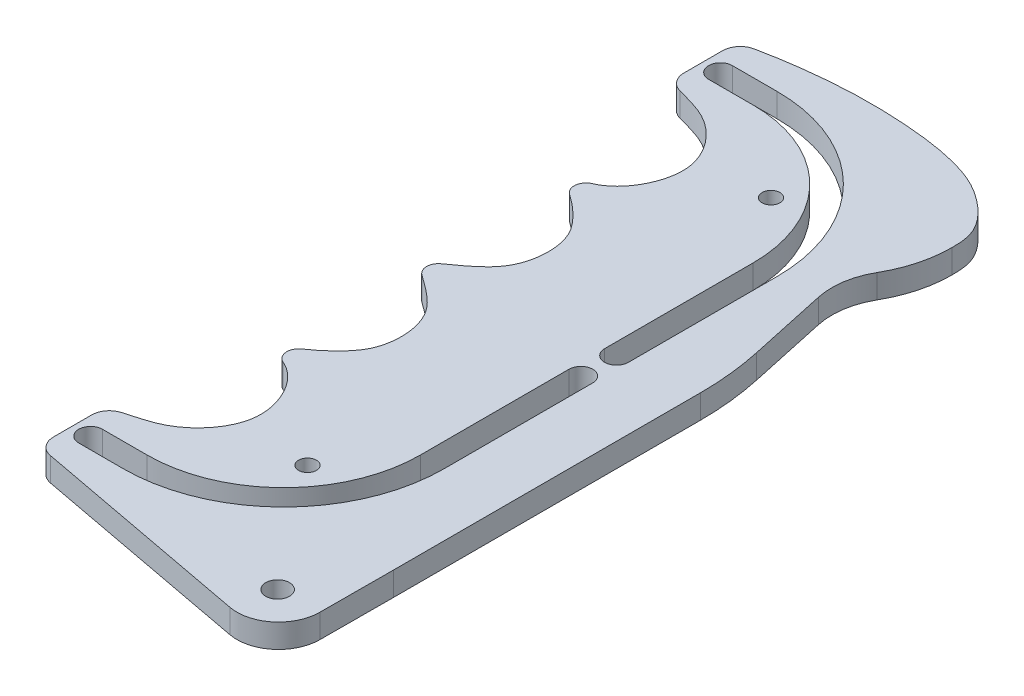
ISO-10303-21;
HEADER;
FILE_DESCRIPTION(('STEP AP214'),'2;1');
FILE_NAME('part.step','',(''),(''),'','','');
FILE_SCHEMA(('AUTOMOTIVE_DESIGN { 1 0 10303 214 1 1 1 1 }'));
ENDSEC;
DATA;
#1=APPLICATION_CONTEXT('core data for automotive mechanical design processes');
#2=APPLICATION_PROTOCOL_DEFINITION('international standard','automotive_design',2000,#1);
#3=PRODUCT_CONTEXT('',#1,'mechanical');
#4=PRODUCT('Part','Part','',(#3));
#5=PRODUCT_RELATED_PRODUCT_CATEGORY('part','',(#4));
#6=PRODUCT_DEFINITION_FORMATION('','',#4);
#7=PRODUCT_DEFINITION_CONTEXT('part definition',#1,'design');
#8=PRODUCT_DEFINITION('design','',#6,#7);
#9=PRODUCT_DEFINITION_SHAPE('','',#8);
#10=(LENGTH_UNIT() NAMED_UNIT(*) SI_UNIT(.MILLI.,.METRE.));
#11=(NAMED_UNIT(*) PLANE_ANGLE_UNIT() SI_UNIT($,.RADIAN.));
#12=(NAMED_UNIT(*) SI_UNIT($,.STERADIAN.) SOLID_ANGLE_UNIT());
#13=UNCERTAINTY_MEASURE_WITH_UNIT(LENGTH_MEASURE(1.E-05),#10,'distance_accuracy_value','');
#14=(GEOMETRIC_REPRESENTATION_CONTEXT(3) GLOBAL_UNCERTAINTY_ASSIGNED_CONTEXT((#13)) GLOBAL_UNIT_ASSIGNED_CONTEXT((#10,
#11,#12)) REPRESENTATION_CONTEXT('',''));
#15=CARTESIAN_POINT('',(0.,0.,0.));
#16=DIRECTION('',(0.,0.,1.));
#17=DIRECTION('',(1.,0.,0.));
#18=AXIS2_PLACEMENT_3D('',#15,#16,#17);
#19=CARTESIAN_POINT('',(0.,2.,-3.));
#20=DIRECTION('',(0.,-1.,0.));
#21=DIRECTION('',(0.,0.,-1.));
#22=AXIS2_PLACEMENT_3D('',#19,#20,#21);
#23=CYLINDRICAL_SURFACE('',#22,2.);
#24=CARTESIAN_POINT('',(0.,-2.,-3.));
#25=DIRECTION('',(0.,1.,0.));
#26=DIRECTION('',(0.,0.,1.));
#27=AXIS2_PLACEMENT_3D('',#24,#25,#26);
#28=CIRCLE('',#27,2.);
#29=CARTESIAN_POINT('',(-2.,-2.,-3.));
#30=VERTEX_POINT('',#29);
#31=CARTESIAN_POINT('',(2.,-2.,-3.));
#32=VERTEX_POINT('',#31);
#33=EDGE_CURVE('E451',#30,#32,#28,.T.);
#34=ORIENTED_EDGE('',*,*,#33,.F.);
#35=DIRECTION('',(0.,-1.,0.));
#36=VECTOR('',#35,1.);
#37=CARTESIAN_POINT('',(-2.,2.,-3.));
#38=LINE('',#37,#36);
#39=CARTESIAN_POINT('',(-2.,2.,-3.));
#40=VERTEX_POINT('',#39);
#41=EDGE_CURVE('E320',#40,#30,#38,.T.);
#42=ORIENTED_EDGE('',*,*,#41,.F.);
#43=CARTESIAN_POINT('',(0.,2.,-3.));
#44=DIRECTION('',(0.,1.,0.));
#45=DIRECTION('',(0.,0.,1.));
#46=AXIS2_PLACEMENT_3D('',#43,#44,#45);
#47=CIRCLE('',#46,2.);
#48=CARTESIAN_POINT('',(2.,2.,-3.));
#49=VERTEX_POINT('',#48);
#50=EDGE_CURVE('E684',#40,#49,#47,.T.);
#51=ORIENTED_EDGE('',*,*,#50,.T.);
#52=DIRECTION('',(0.,-1.,0.));
#53=VECTOR('',#52,1.);
#54=CARTESIAN_POINT('',(2.,2.,-3.));
#55=LINE('',#54,#53);
#56=EDGE_CURVE('E480',#49,#32,#55,.T.);
#57=ORIENTED_EDGE('',*,*,#56,.T.);
#58=EDGE_LOOP('',(#34,#42,#51,#57));
#59=FACE_BOUND('',#58,.T.);
#60=ADVANCED_FACE('F35',(#59),#23,.F.);
#61=CARTESIAN_POINT('',(-2.,2.,0.));
#62=DIRECTION('',(1.,0.,0.));
#63=DIRECTION('',(0.,0.,-1.));
#64=AXIS2_PLACEMENT_3D('',#61,#62,#63);
#65=PLANE('',#64);
#66=DIRECTION('',(0.,0.,1.));
#67=VECTOR('',#66,1.);
#68=CARTESIAN_POINT('',(-2.,-2.,0.));
#69=LINE('',#68,#67);
#70=CARTESIAN_POINT('',(-2.,-2.,-28.));
#71=VERTEX_POINT('',#70);
#72=EDGE_CURVE('E454',#71,#30,#69,.T.);
#73=ORIENTED_EDGE('',*,*,#72,.F.);
#74=DIRECTION('',(0.,-1.,0.));
#75=VECTOR('',#74,1.);
#76=CARTESIAN_POINT('',(-2.,2.,-28.));
#77=LINE('',#76,#75);
#78=CARTESIAN_POINT('',(-2.,2.,-28.));
#79=VERTEX_POINT('',#78);
#80=EDGE_CURVE('E495',#79,#71,#77,.T.);
#81=ORIENTED_EDGE('',*,*,#80,.F.);
#82=DIRECTION('',(0.,0.,1.));
#83=VECTOR('',#82,1.);
#84=CARTESIAN_POINT('',(-2.,2.,0.));
#85=LINE('',#84,#83);
#86=EDGE_CURVE('E687',#79,#40,#85,.T.);
#87=ORIENTED_EDGE('',*,*,#86,.T.);
#88=ORIENTED_EDGE('',*,*,#41,.T.);
#89=EDGE_LOOP('',(#73,#81,#87,#88));
#90=FACE_BOUND('',#89,.T.);
#91=ADVANCED_FACE('F582',(#90),#65,.T.);
#92=CARTESIAN_POINT('',(-25.,2.,-28.));
#93=DIRECTION('',(0.,-1.,0.));
#94=DIRECTION('',(0.,0.,-1.));
#95=AXIS2_PLACEMENT_3D('',#92,#93,#94);
#96=CYLINDRICAL_SURFACE('',#95,23.);
#97=CARTESIAN_POINT('',(-25.,-2.,-28.));
#98=DIRECTION('',(0.,1.,0.));
#99=DIRECTION('',(0.,0.,1.));
#100=AXIS2_PLACEMENT_3D('',#97,#98,#99);
#101=CIRCLE('',#100,23.);
#102=CARTESIAN_POINT('',(-25.,-2.,-51.));
#103=VERTEX_POINT('',#102);
#104=EDGE_CURVE('E457',#103,#71,#101,.F.);
#105=ORIENTED_EDGE('',*,*,#104,.F.);
#106=DIRECTION('',(0.,-1.,0.));
#107=VECTOR('',#106,1.);
#108=CARTESIAN_POINT('',(-25.,2.,-51.));
#109=LINE('',#108,#107);
#110=CARTESIAN_POINT('',(-25.,2.,-51.));
#111=VERTEX_POINT('',#110);
#112=EDGE_CURVE('E493',#111,#103,#109,.T.);
#113=ORIENTED_EDGE('',*,*,#112,.F.);
#114=CARTESIAN_POINT('',(-25.,2.,-28.));
#115=DIRECTION('',(0.,1.,0.));
#116=DIRECTION('',(0.,0.,1.));
#117=AXIS2_PLACEMENT_3D('',#114,#115,#116);
#118=CIRCLE('',#117,23.);
#119=EDGE_CURVE('E690',#111,#79,#118,.F.);
#120=ORIENTED_EDGE('',*,*,#119,.T.);
#121=ORIENTED_EDGE('',*,*,#80,.T.);
#122=EDGE_LOOP('',(#105,#113,#120,#121));
#123=FACE_BOUND('',#122,.T.);
#124=ADVANCED_FACE('F588',(#123),#96,.T.);
#125=CARTESIAN_POINT('',(0.,2.,-51.));
#126=DIRECTION('',(0.,0.,-1.));
#127=DIRECTION('',(-1.,0.,0.));
#128=AXIS2_PLACEMENT_3D('',#125,#126,#127);
#129=PLANE('',#128);
#130=DIRECTION('',(1.,0.,0.));
#131=VECTOR('',#130,1.);
#132=CARTESIAN_POINT('',(0.,-2.,-51.));
#133=LINE('',#132,#131);
#134=CARTESIAN_POINT('',(-32.5,-2.,-51.));
#135=VERTEX_POINT('',#134);
#136=EDGE_CURVE('E460',#135,#103,#133,.T.);
#137=ORIENTED_EDGE('',*,*,#136,.F.);
#138=DIRECTION('',(0.,-1.,0.));
#139=VECTOR('',#138,1.);
#140=CARTESIAN_POINT('',(-32.5,2.,-51.));
#141=LINE('',#140,#139);
#142=CARTESIAN_POINT('',(-32.5,2.,-51.));
#143=VERTEX_POINT('',#142);
#144=EDGE_CURVE('E491',#143,#135,#141,.T.);
#145=ORIENTED_EDGE('',*,*,#144,.F.);
#146=DIRECTION('',(1.,0.,0.));
#147=VECTOR('',#146,1.);
#148=CARTESIAN_POINT('',(0.,2.,-51.));
#149=LINE('',#148,#147);
#150=EDGE_CURVE('E693',#143,#111,#149,.T.);
#151=ORIENTED_EDGE('',*,*,#150,.T.);
#152=ORIENTED_EDGE('',*,*,#112,.T.);
#153=EDGE_LOOP('',(#137,#145,#151,#152));
#154=FACE_BOUND('',#153,.T.);
#155=ADVANCED_FACE('F747',(#154),#129,.T.);
#156=CARTESIAN_POINT('',(-32.5,2.,-53.));
#157=DIRECTION('',(0.,-1.,0.));
#158=DIRECTION('',(0.,0.,-1.));
#159=AXIS2_PLACEMENT_3D('',#156,#157,#158);
#160=CYLINDRICAL_SURFACE('',#159,2.);
#161=CARTESIAN_POINT('',(-32.5,-2.,-53.));
#162=DIRECTION('',(0.,1.,0.));
#163=DIRECTION('',(0.,0.,1.));
#164=AXIS2_PLACEMENT_3D('',#161,#162,#163);
#165=CIRCLE('',#164,2.);
#166=CARTESIAN_POINT('',(-32.5,-2.,-55.));
#167=VERTEX_POINT('',#166);
#168=EDGE_CURVE('E463',#167,#135,#165,.T.);
#169=ORIENTED_EDGE('',*,*,#168,.F.);
#170=DIRECTION('',(0.,-1.,0.));
#171=VECTOR('',#170,1.);
#172=CARTESIAN_POINT('',(-32.5,2.,-55.));
#173=LINE('',#172,#171);
#174=CARTESIAN_POINT('',(-32.5,2.,-55.));
#175=VERTEX_POINT('',#174);
#176=EDGE_CURVE('E489',#175,#167,#173,.T.);
#177=ORIENTED_EDGE('',*,*,#176,.F.);
#178=CARTESIAN_POINT('',(-32.5,2.,-53.));
#179=DIRECTION('',(0.,1.,0.));
#180=DIRECTION('',(0.,0.,1.));
#181=AXIS2_PLACEMENT_3D('',#178,#179,#180);
#182=CIRCLE('',#181,2.);
#183=EDGE_CURVE('E696',#175,#143,#182,.T.);
#184=ORIENTED_EDGE('',*,*,#183,.T.);
#185=ORIENTED_EDGE('',*,*,#144,.T.);
#186=EDGE_LOOP('',(#169,#177,#184,#185));
#187=FACE_BOUND('',#186,.T.);
#188=ADVANCED_FACE('F743',(#187),#160,.F.);
#189=CARTESIAN_POINT('',(0.,2.,-55.));
#190=DIRECTION('',(0.,0.,-1.));
#191=DIRECTION('',(-1.,0.,0.));
#192=AXIS2_PLACEMENT_3D('',#189,#190,#191);
#193=PLANE('',#192);
#194=DIRECTION('',(1.,0.,0.));
#195=VECTOR('',#194,1.);
#196=CARTESIAN_POINT('',(0.,-2.,-55.));
#197=LINE('',#196,#195);
#198=CARTESIAN_POINT('',(-25.,-2.,-55.));
#199=VERTEX_POINT('',#198);
#200=EDGE_CURVE('E466',#167,#199,#197,.T.);
#201=ORIENTED_EDGE('',*,*,#200,.T.);
#202=DIRECTION('',(0.,-1.,0.));
#203=VECTOR('',#202,1.);
#204=CARTESIAN_POINT('',(-25.,2.,-55.));
#205=LINE('',#204,#203);
#206=CARTESIAN_POINT('',(-25.,2.,-55.));
#207=VERTEX_POINT('',#206);
#208=EDGE_CURVE('E486',#207,#199,#205,.T.);
#209=ORIENTED_EDGE('',*,*,#208,.F.);
#210=DIRECTION('',(1.,0.,0.));
#211=VECTOR('',#210,1.);
#212=CARTESIAN_POINT('',(0.,2.,-55.));
#213=LINE('',#212,#211);
#214=EDGE_CURVE('E699',#175,#207,#213,.T.);
#215=ORIENTED_EDGE('',*,*,#214,.F.);
#216=ORIENTED_EDGE('',*,*,#176,.T.);
#217=EDGE_LOOP('',(#201,#209,#215,#216));
#218=FACE_BOUND('',#217,.T.);
#219=ADVANCED_FACE('F739',(#218),#193,.F.);
#220=CARTESIAN_POINT('',(-25.,2.,-28.));
#221=DIRECTION('',(0.,-1.,0.));
#222=DIRECTION('',(0.,0.,-1.));
#223=AXIS2_PLACEMENT_3D('',#220,#221,#222);
#224=CYLINDRICAL_SURFACE('',#223,27.);
#225=CARTESIAN_POINT('',(-25.,-2.,-28.));
#226=DIRECTION('',(0.,1.,0.));
#227=DIRECTION('',(0.,0.,1.));
#228=AXIS2_PLACEMENT_3D('',#225,#226,#227);
#229=CIRCLE('',#228,27.);
#230=CARTESIAN_POINT('',(2.,-2.,-28.));
#231=VERTEX_POINT('',#230);
#232=EDGE_CURVE('E469',#199,#231,#229,.F.);
#233=ORIENTED_EDGE('',*,*,#232,.T.);
#234=DIRECTION('',(0.,-1.,0.));
#235=VECTOR('',#234,1.);
#236=CARTESIAN_POINT('',(2.,2.,-28.));
#237=LINE('',#236,#235);
#238=CARTESIAN_POINT('',(2.,2.,-28.));
#239=VERTEX_POINT('',#238);
#240=EDGE_CURVE('E482',#239,#231,#237,.T.);
#241=ORIENTED_EDGE('',*,*,#240,.F.);
#242=CARTESIAN_POINT('',(-25.,2.,-28.));
#243=DIRECTION('',(0.,1.,0.));
#244=DIRECTION('',(0.,0.,1.));
#245=AXIS2_PLACEMENT_3D('',#242,#243,#244);
#246=CIRCLE('',#245,27.);
#247=EDGE_CURVE('E702',#207,#239,#246,.F.);
#248=ORIENTED_EDGE('',*,*,#247,.F.);
#249=ORIENTED_EDGE('',*,*,#208,.T.);
#250=EDGE_LOOP('',(#233,#241,#248,#249));
#251=FACE_BOUND('',#250,.T.);
#252=ADVANCED_FACE('F627',(#251),#224,.F.);
#253=CARTESIAN_POINT('',(-25.,2.,28.));
#254=DIRECTION('',(0.,-1.,0.));
#255=DIRECTION('',(0.,0.,-1.));
#256=AXIS2_PLACEMENT_3D('',#253,#254,#255);
#257=CYLINDRICAL_SURFACE('',#256,27.);
#258=CARTESIAN_POINT('',(-25.,-2.,28.));
#259=DIRECTION('',(0.,1.,0.));
#260=DIRECTION('',(0.,0.,1.));
#261=AXIS2_PLACEMENT_3D('',#258,#259,#260);
#262=CIRCLE('',#261,27.);
#263=CARTESIAN_POINT('',(-25.,-2.,55.));
#264=VERTEX_POINT('',#263);
#265=CARTESIAN_POINT('',(2.,-2.,28.));
#266=VERTEX_POINT('',#265);
#267=EDGE_CURVE('E427',#264,#266,#262,.T.);
#268=ORIENTED_EDGE('',*,*,#267,.F.);
#269=DIRECTION('',(0.,-1.,0.));
#270=VECTOR('',#269,1.);
#271=CARTESIAN_POINT('',(-25.,2.,55.));
#272=LINE('',#271,#270);
#273=CARTESIAN_POINT('',(-25.,2.,55.));
#274=VERTEX_POINT('',#273);
#275=EDGE_CURVE('E483',#274,#264,#272,.T.);
#276=ORIENTED_EDGE('',*,*,#275,.F.);
#277=CARTESIAN_POINT('',(-25.,2.,28.));
#278=DIRECTION('',(0.,1.,0.));
#279=DIRECTION('',(0.,0.,1.));
#280=AXIS2_PLACEMENT_3D('',#277,#278,#279);
#281=CIRCLE('',#280,27.);
#282=CARTESIAN_POINT('',(2.,2.,28.));
#283=VERTEX_POINT('',#282);
#284=EDGE_CURVE('E661',#274,#283,#281,.T.);
#285=ORIENTED_EDGE('',*,*,#284,.T.);
#286=DIRECTION('',(0.,-1.,0.));
#287=VECTOR('',#286,1.);
#288=CARTESIAN_POINT('',(2.,2.,28.));
#289=LINE('',#288,#287);
#290=EDGE_CURVE('E308',#283,#266,#289,.T.);
#291=ORIENTED_EDGE('',*,*,#290,.T.);
#292=EDGE_LOOP('',(#268,#276,#285,#291));
#293=FACE_BOUND('',#292,.T.);
#294=ADVANCED_FACE('F623',(#293),#257,.F.);
#295=CARTESIAN_POINT('',(0.,2.,55.));
#296=DIRECTION('',(0.,0.,-1.));
#297=DIRECTION('',(-1.,0.,0.));
#298=AXIS2_PLACEMENT_3D('',#295,#296,#297);
#299=PLANE('',#298);
#300=DIRECTION('',(1.,0.,0.));
#301=VECTOR('',#300,1.);
#302=CARTESIAN_POINT('',(0.,-2.,55.));
#303=LINE('',#302,#301);
#304=CARTESIAN_POINT('',(-32.5,-2.,55.));
#305=VERTEX_POINT('',#304);
#306=EDGE_CURVE('E430',#305,#264,#303,.T.);
#307=ORIENTED_EDGE('',*,*,#306,.F.);
#308=DIRECTION('',(0.,-1.,0.));
#309=VECTOR('',#308,1.);
#310=CARTESIAN_POINT('',(-32.5,2.,55.));
#311=LINE('',#310,#309);
#312=CARTESIAN_POINT('',(-32.5,2.,55.));
#313=VERTEX_POINT('',#312);
#314=EDGE_CURVE('E511',#313,#305,#311,.T.);
#315=ORIENTED_EDGE('',*,*,#314,.F.);
#316=DIRECTION('',(1.,0.,0.));
#317=VECTOR('',#316,1.);
#318=CARTESIAN_POINT('',(0.,2.,55.));
#319=LINE('',#318,#317);
#320=EDGE_CURVE('E664',#313,#274,#319,.T.);
#321=ORIENTED_EDGE('',*,*,#320,.T.);
#322=ORIENTED_EDGE('',*,*,#275,.T.);
#323=EDGE_LOOP('',(#307,#315,#321,#322));
#324=FACE_BOUND('',#323,.T.);
#325=ADVANCED_FACE('F619',(#324),#299,.T.);
#326=CARTESIAN_POINT('',(-32.5,2.,53.));
#327=DIRECTION('',(0.,-1.,0.));
#328=DIRECTION('',(0.,0.,-1.));
#329=AXIS2_PLACEMENT_3D('',#326,#327,#328);
#330=CYLINDRICAL_SURFACE('',#329,2.);
#331=CARTESIAN_POINT('',(-32.5,-2.,53.));
#332=DIRECTION('',(0.,1.,0.));
#333=DIRECTION('',(0.,0.,1.));
#334=AXIS2_PLACEMENT_3D('',#331,#332,#333);
#335=CIRCLE('',#334,2.);
#336=CARTESIAN_POINT('',(-32.5,-2.,51.));
#337=VERTEX_POINT('',#336);
#338=EDGE_CURVE('E433',#305,#337,#335,.F.);
#339=ORIENTED_EDGE('',*,*,#338,.T.);
#340=DIRECTION('',(0.,-1.,0.));
#341=VECTOR('',#340,1.);
#342=CARTESIAN_POINT('',(-32.5,2.,51.));
#343=LINE('',#342,#341);
#344=CARTESIAN_POINT('',(-32.5,2.,51.));
#345=VERTEX_POINT('',#344);
#346=EDGE_CURVE('E508',#345,#337,#343,.T.);
#347=ORIENTED_EDGE('',*,*,#346,.F.);
#348=CARTESIAN_POINT('',(-32.5,2.,53.));
#349=DIRECTION('',(0.,1.,0.));
#350=DIRECTION('',(0.,0.,1.));
#351=AXIS2_PLACEMENT_3D('',#348,#349,#350);
#352=CIRCLE('',#351,2.);
#353=EDGE_CURVE('E667',#313,#345,#352,.F.);
#354=ORIENTED_EDGE('',*,*,#353,.F.);
#355=ORIENTED_EDGE('',*,*,#314,.T.);
#356=EDGE_LOOP('',(#339,#347,#354,#355));
#357=FACE_BOUND('',#356,.T.);
#358=ADVANCED_FACE('F615',(#357),#330,.F.);
#359=CARTESIAN_POINT('',(0.,2.,51.));
#360=DIRECTION('',(0.,0.,-1.));
#361=DIRECTION('',(-1.,0.,0.));
#362=AXIS2_PLACEMENT_3D('',#359,#360,#361);
#363=PLANE('',#362);
#364=DIRECTION('',(1.,0.,0.));
#365=VECTOR('',#364,1.);
#366=CARTESIAN_POINT('',(0.,-2.,51.));
#367=LINE('',#366,#365);
#368=CARTESIAN_POINT('',(-25.,-2.,51.));
#369=VERTEX_POINT('',#368);
#370=EDGE_CURVE('E436',#337,#369,#367,.T.);
#371=ORIENTED_EDGE('',*,*,#370,.T.);
#372=DIRECTION('',(0.,-1.,0.));
#373=VECTOR('',#372,1.);
#374=CARTESIAN_POINT('',(-25.,2.,51.));
#375=LINE('',#374,#373);
#376=CARTESIAN_POINT('',(-25.,2.,51.));
#377=VERTEX_POINT('',#376);
#378=EDGE_CURVE('E505',#377,#369,#375,.T.);
#379=ORIENTED_EDGE('',*,*,#378,.F.);
#380=DIRECTION('',(1.,0.,0.));
#381=VECTOR('',#380,1.);
#382=CARTESIAN_POINT('',(0.,2.,51.));
#383=LINE('',#382,#381);
#384=EDGE_CURVE('E670',#345,#377,#383,.T.);
#385=ORIENTED_EDGE('',*,*,#384,.F.);
#386=ORIENTED_EDGE('',*,*,#346,.T.);
#387=EDGE_LOOP('',(#371,#379,#385,#386));
#388=FACE_BOUND('',#387,.T.);
#389=ADVANCED_FACE('F611',(#388),#363,.F.);
#390=CARTESIAN_POINT('',(-25.,2.,28.));
#391=DIRECTION('',(0.,-1.,0.));
#392=DIRECTION('',(0.,0.,-1.));
#393=AXIS2_PLACEMENT_3D('',#390,#391,#392);
#394=CYLINDRICAL_SURFACE('',#393,23.);
#395=CARTESIAN_POINT('',(-25.,-2.,28.));
#396=DIRECTION('',(0.,1.,0.));
#397=DIRECTION('',(0.,0.,1.));
#398=AXIS2_PLACEMENT_3D('',#395,#396,#397);
#399=CIRCLE('',#398,23.);
#400=CARTESIAN_POINT('',(-2.,-2.,28.));
#401=VERTEX_POINT('',#400);
#402=EDGE_CURVE('E439',#369,#401,#399,.T.);
#403=ORIENTED_EDGE('',*,*,#402,.T.);
#404=DIRECTION('',(0.,-1.,0.));
#405=VECTOR('',#404,1.);
#406=CARTESIAN_POINT('',(-2.,2.,28.));
#407=LINE('',#406,#405);
#408=CARTESIAN_POINT('',(-2.,2.,28.));
#409=VERTEX_POINT('',#408);
#410=EDGE_CURVE('E502',#409,#401,#407,.T.);
#411=ORIENTED_EDGE('',*,*,#410,.F.);
#412=CARTESIAN_POINT('',(-25.,2.,28.));
#413=DIRECTION('',(0.,1.,0.));
#414=DIRECTION('',(0.,0.,1.));
#415=AXIS2_PLACEMENT_3D('',#412,#413,#414);
#416=CIRCLE('',#415,23.);
#417=EDGE_CURVE('E673',#377,#409,#416,.T.);
#418=ORIENTED_EDGE('',*,*,#417,.F.);
#419=ORIENTED_EDGE('',*,*,#378,.T.);
#420=EDGE_LOOP('',(#403,#411,#418,#419));
#421=FACE_BOUND('',#420,.T.);
#422=ADVANCED_FACE('F607',(#421),#394,.T.);
#423=CARTESIAN_POINT('',(-2.,2.,0.));
#424=DIRECTION('',(-1.,0.,0.));
#425=DIRECTION('',(0.,0.,1.));
#426=AXIS2_PLACEMENT_3D('',#423,#424,#425);
#427=PLANE('',#426);
#428=DIRECTION('',(0.,0.,-1.));
#429=VECTOR('',#428,1.);
#430=CARTESIAN_POINT('',(-2.,-2.,0.));
#431=LINE('',#430,#429);
#432=CARTESIAN_POINT('',(-2.,-2.,3.));
#433=VERTEX_POINT('',#432);
#434=EDGE_CURVE('E442',#401,#433,#431,.T.);
#435=ORIENTED_EDGE('',*,*,#434,.T.);
#436=DIRECTION('',(0.,-1.,0.));
#437=VECTOR('',#436,1.);
#438=CARTESIAN_POINT('',(-2.,2.,3.));
#439=LINE('',#438,#437);
#440=CARTESIAN_POINT('',(-2.,2.,3.));
#441=VERTEX_POINT('',#440);
#442=EDGE_CURVE('E499',#441,#433,#439,.T.);
#443=ORIENTED_EDGE('',*,*,#442,.F.);
#444=DIRECTION('',(0.,0.,-1.));
#445=VECTOR('',#444,1.);
#446=CARTESIAN_POINT('',(-2.,2.,0.));
#447=LINE('',#446,#445);
#448=EDGE_CURVE('E676',#409,#441,#447,.T.);
#449=ORIENTED_EDGE('',*,*,#448,.F.);
#450=ORIENTED_EDGE('',*,*,#410,.T.);
#451=EDGE_LOOP('',(#435,#443,#449,#450));
#452=FACE_BOUND('',#451,.T.);
#453=ADVANCED_FACE('F603',(#452),#427,.F.);
#454=CARTESIAN_POINT('',(0.,2.,3.));
#455=DIRECTION('',(0.,-1.,0.));
#456=DIRECTION('',(0.,0.,-1.));
#457=AXIS2_PLACEMENT_3D('',#454,#455,#456);
#458=CYLINDRICAL_SURFACE('',#457,2.);
#459=CARTESIAN_POINT('',(0.,-2.,3.));
#460=DIRECTION('',(0.,1.,0.));
#461=DIRECTION('',(0.,0.,1.));
#462=AXIS2_PLACEMENT_3D('',#459,#460,#461);
#463=CIRCLE('',#462,2.);
#464=CARTESIAN_POINT('',(2.,-2.,3.));
#465=VERTEX_POINT('',#464);
#466=EDGE_CURVE('E445',#433,#465,#463,.F.);
#467=ORIENTED_EDGE('',*,*,#466,.T.);
#468=DIRECTION('',(0.,-1.,0.));
#469=VECTOR('',#468,1.);
#470=CARTESIAN_POINT('',(2.,2.,3.));
#471=LINE('',#470,#469);
#472=CARTESIAN_POINT('',(2.,2.,3.));
#473=VERTEX_POINT('',#472);
#474=EDGE_CURVE('E310',#473,#465,#471,.T.);
#475=ORIENTED_EDGE('',*,*,#474,.F.);
#476=CARTESIAN_POINT('',(0.,2.,3.));
#477=DIRECTION('',(0.,1.,0.));
#478=DIRECTION('',(0.,0.,1.));
#479=AXIS2_PLACEMENT_3D('',#476,#477,#478);
#480=CIRCLE('',#479,2.);
#481=EDGE_CURVE('E679',#441,#473,#480,.F.);
#482=ORIENTED_EDGE('',*,*,#481,.F.);
#483=ORIENTED_EDGE('',*,*,#442,.T.);
#484=EDGE_LOOP('',(#467,#475,#482,#483));
#485=FACE_BOUND('',#484,.T.);
#486=ADVANCED_FACE('F600',(#485),#458,.F.);
#487=CARTESIAN_POINT('',(-11.9072006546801,2.,63.1953314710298));
#488=DIRECTION('',(0.185160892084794,0.,-0.982708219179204));
#489=DIRECTION('',(-0.982708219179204,0.,-0.185160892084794));
#490=AXIS2_PLACEMENT_3D('',#487,#488,#489);
#491=PLANE('',#490);
#492=DIRECTION('',(0.982708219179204,0.,0.185160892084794));
#493=VECTOR('',#492,1.);
#494=CARTESIAN_POINT('',(-11.9072006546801,2.,63.1953314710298));
#495=LINE('',#494,#493);
#496=CARTESIAN_POINT('',(-33.0554826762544,2.,59.2105934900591));
#497=VERTEX_POINT('',#496);
#498=CARTESIAN_POINT('',(4.1622015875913,2.,66.223112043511));
#499=VERTEX_POINT('',#498);
#500=EDGE_CURVE('E279',#497,#499,#495,.T.);
#501=ORIENTED_EDGE('',*,*,#500,.F.);
#502=DIRECTION('',(0.,-1.,0.));
#503=VECTOR('',#502,1.);
#504=CARTESIAN_POINT('',(-33.0554826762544,-2.,59.2105934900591));
#505=LINE('',#504,#503);
#506=CARTESIAN_POINT('',(-33.0554826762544,-2.,59.2105934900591));
#507=VERTEX_POINT('',#506);
#508=EDGE_CURVE('E326',#497,#507,#505,.T.);
#509=ORIENTED_EDGE('',*,*,#508,.T.);
#510=DIRECTION('',(0.982708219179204,0.,0.185160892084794));
#511=VECTOR('',#510,1.);
#512=CARTESIAN_POINT('',(-11.9072006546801,-2.,63.1953314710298));
#513=LINE('',#512,#511);
#514=CARTESIAN_POINT('',(4.1622015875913,-2.,66.223112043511));
#515=VERTEX_POINT('',#514);
#516=EDGE_CURVE('E306',#507,#515,#513,.T.);
#517=ORIENTED_EDGE('',*,*,#516,.T.);
#518=DIRECTION('',(0.,-1.,0.));
#519=VECTOR('',#518,1.);
#520=CARTESIAN_POINT('',(4.1622015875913,2.,66.223112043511));
#521=LINE('',#520,#519);
#522=EDGE_CURVE('E299',#499,#515,#521,.T.);
#523=ORIENTED_EDGE('',*,*,#522,.F.);
#524=EDGE_LOOP('',(#501,#509,#517,#523));
#525=FACE_BOUND('',#524,.T.);
#526=ADVANCED_FACE('F304',(#525),#491,.F.);
#527=CARTESIAN_POINT('',(5.45832783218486,2.,59.3441545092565));
#528=DIRECTION('',(0.,-1.,0.));
#529=DIRECTION('',(0.,0.,-1.));
#530=AXIS2_PLACEMENT_3D('',#527,#528,#529);
#531=CYLINDRICAL_SURFACE('',#530,7.);
#532=CARTESIAN_POINT('',(5.45832783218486,-2.,59.3441545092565));
#533=DIRECTION('',(0.,1.,0.));
#534=DIRECTION('',(0.,0.,1.));
#535=AXIS2_PLACEMENT_3D('',#532,#533,#534);
#536=CIRCLE('',#535,7.);
#537=CARTESIAN_POINT('',(12.4582880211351,-2.,59.3677628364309));
#538=VERTEX_POINT('',#537);
#539=EDGE_CURVE('E552',#515,#538,#536,.T.);
#540=ORIENTED_EDGE('',*,*,#539,.T.);
#541=DIRECTION('',(0.,-1.,0.));
#542=VECTOR('',#541,1.);
#543=CARTESIAN_POINT('',(12.4582880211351,2.,59.3677628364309));
#544=LINE('',#543,#542);
#545=CARTESIAN_POINT('',(12.4582880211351,2.,59.3677628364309));
#546=VERTEX_POINT('',#545);
#547=EDGE_CURVE('E300',#546,#538,#544,.T.);
#548=ORIENTED_EDGE('',*,*,#547,.F.);
#549=CARTESIAN_POINT('',(5.45832783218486,2.,59.3441545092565));
#550=DIRECTION('',(0.,1.,0.));
#551=DIRECTION('',(0.,0.,1.));
#552=AXIS2_PLACEMENT_3D('',#549,#550,#551);
#553=CIRCLE('',#552,7.);
#554=EDGE_CURVE('E285',#499,#546,#553,.T.);
#555=ORIENTED_EDGE('',*,*,#554,.F.);
#556=ORIENTED_EDGE('',*,*,#522,.T.);
#557=EDGE_LOOP('',(#540,#548,#555,#556));
#558=FACE_BOUND('',#557,.T.);
#559=ADVANCED_FACE('F298',(#558),#531,.T.);
#560=CARTESIAN_POINT('',(12.6583699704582,2.,0.0426920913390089));
#561=DIRECTION('',(0.999994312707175,0.,0.00337261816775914));
#562=DIRECTION('',(0.00337261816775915,0.,-0.999994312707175));
#563=AXIS2_PLACEMENT_3D('',#560,#561,#562);
#564=PLANE('',#563);
#565=DIRECTION('',(-0.00337261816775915,0.,0.999994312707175));
#566=VECTOR('',#565,1.);
#567=CARTESIAN_POINT('',(12.6583699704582,-2.,0.0426920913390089));
#568=LINE('',#567,#566);
#569=CARTESIAN_POINT('',(12.5,-2.,47.));
#570=VERTEX_POINT('',#569);
#571=EDGE_CURVE('E547',#570,#538,#568,.T.);
#572=ORIENTED_EDGE('',*,*,#571,.F.);
#573=DIRECTION('',(0.,-1.,0.));
#574=VECTOR('',#573,1.);
#575=CARTESIAN_POINT('',(12.5,2.,47.));
#576=LINE('',#575,#574);
#577=CARTESIAN_POINT('',(12.5,2.,47.));
#578=VERTEX_POINT('',#577);
#579=EDGE_CURVE('E312',#578,#570,#576,.T.);
#580=ORIENTED_EDGE('',*,*,#579,.F.);
#581=DIRECTION('',(-0.00337261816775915,0.,0.999994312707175));
#582=VECTOR('',#581,1.);
#583=CARTESIAN_POINT('',(12.6583699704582,2.,0.0426920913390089));
#584=LINE('',#583,#582);
#585=EDGE_CURVE('E302',#578,#546,#584,.T.);
#586=ORIENTED_EDGE('',*,*,#585,.T.);
#587=ORIENTED_EDGE('',*,*,#547,.T.);
#588=EDGE_LOOP('',(#572,#580,#586,#587));
#589=FACE_BOUND('',#588,.T.);
#590=ADVANCED_FACE('F551',(#589),#564,.T.);
#591=CARTESIAN_POINT('',(12.5,2.,0.));
#592=DIRECTION('',(-1.,0.,0.));
#593=DIRECTION('',(0.,0.,1.));
#594=AXIS2_PLACEMENT_3D('',#591,#592,#593);
#595=PLANE('',#594);
#596=DIRECTION('',(0.,0.,-1.));
#597=VECTOR('',#596,1.);
#598=CARTESIAN_POINT('',(12.5,-2.,0.));
#599=LINE('',#598,#597);
#600=CARTESIAN_POINT('',(12.5,-2.,-4.6535863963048));
#601=VERTEX_POINT('',#600);
#602=EDGE_CURVE('E540',#570,#601,#599,.T.);
#603=ORIENTED_EDGE('',*,*,#602,.T.);
#604=DIRECTION('',(0.,-1.,0.));
#605=VECTOR('',#604,1.);
#606=CARTESIAN_POINT('',(12.5,2.,-4.6535863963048));
#607=LINE('',#606,#605);
#608=CARTESIAN_POINT('',(12.5,2.,-4.6535863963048));
#609=VERTEX_POINT('',#608);
#610=EDGE_CURVE('E322',#601,#609,#607,.F.);
#611=ORIENTED_EDGE('',*,*,#610,.T.);
#612=DIRECTION('',(0.,0.,-1.));
#613=VECTOR('',#612,1.);
#614=CARTESIAN_POINT('',(12.5,2.,0.));
#615=LINE('',#614,#613);
#616=EDGE_CURVE('E543',#578,#609,#615,.T.);
#617=ORIENTED_EDGE('',*,*,#616,.F.);
#618=ORIENTED_EDGE('',*,*,#579,.T.);
#619=EDGE_LOOP('',(#603,#611,#617,#618));
#620=FACE_BOUND('',#619,.T.);
#621=ADVANCED_FACE('F539',(#620),#595,.F.);
#622=CARTESIAN_POINT('',(14.0077556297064,2.,-3.03029758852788));
#623=DIRECTION('',(0.977391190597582,0.,-0.21143902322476));
#624=DIRECTION('',(-0.21143902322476,0.,-0.977391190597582));
#625=AXIS2_PLACEMENT_3D('',#622,#623,#624);
#626=PLANE('',#625);
#627=DIRECTION('',(0.21143902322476,0.,0.977391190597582));
#628=VECTOR('',#627,1.);
#629=CARTESIAN_POINT('',(14.0077556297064,2.,-3.03029758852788));
#630=LINE('',#629,#628);
#631=CARTESIAN_POINT('',(8.5,2.,-28.4902706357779));
#632=VERTEX_POINT('',#631);
#633=CARTESIAN_POINT('',(11.3695595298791,2.,-15.2255375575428));
#634=VERTEX_POINT('',#633);
#635=EDGE_CURVE('E1056',#632,#634,#630,.T.);
#636=ORIENTED_EDGE('',*,*,#635,.T.);
#637=DIRECTION('',(0.,-1.,0.));
#638=VECTOR('',#637,1.);
#639=CARTESIAN_POINT('',(11.3695595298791,-2.,-15.2255375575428));
#640=LINE('',#639,#638);
#641=CARTESIAN_POINT('',(11.3695595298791,-2.,-15.2255375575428));
#642=VERTEX_POINT('',#641);
#643=EDGE_CURVE('E316',#634,#642,#640,.T.);
#644=ORIENTED_EDGE('',*,*,#643,.T.);
#645=DIRECTION('',(0.21143902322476,0.,0.977391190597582));
#646=VECTOR('',#645,1.);
#647=CARTESIAN_POINT('',(14.0077556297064,-2.,-3.03029758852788));
#648=LINE('',#647,#646);
#649=CARTESIAN_POINT('',(8.5,-2.,-28.4902706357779));
#650=VERTEX_POINT('',#649);
#651=EDGE_CURVE('E549',#650,#642,#648,.T.);
#652=ORIENTED_EDGE('',*,*,#651,.F.);
#653=DIRECTION('',(0.,-1.,0.));
#654=VECTOR('',#653,1.);
#655=CARTESIAN_POINT('',(8.5,2.,-28.4902706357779));
#656=LINE('',#655,#654);
#657=EDGE_CURVE('E534',#632,#650,#656,.T.);
#658=ORIENTED_EDGE('',*,*,#657,.F.);
#659=EDGE_LOOP('',(#636,#644,#652,#658));
#660=FACE_BOUND('',#659,.T.);
#661=ADVANCED_FACE('F849',(#660),#626,.T.);
#662=CARTESIAN_POINT('',(20.228694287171,2.,-31.027538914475));
#663=DIRECTION('',(0.,-1.,0.));
#664=DIRECTION('',(0.,0.,-1.));
#665=AXIS2_PLACEMENT_3D('',#662,#663,#664);
#666=CYLINDRICAL_SURFACE('',#665,12.);
#667=CARTESIAN_POINT('',(20.228694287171,-2.,-31.027538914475));
#668=DIRECTION('',(0.,1.,0.));
#669=DIRECTION('',(0.,0.,1.));
#670=AXIS2_PLACEMENT_3D('',#667,#668,#669);
#671=CIRCLE('',#670,12.);
#672=CARTESIAN_POINT('',(9.83043392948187,-2.,-37.0172118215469));
#673=VERTEX_POINT('',#672);
#674=EDGE_CURVE('E558',#673,#650,#671,.T.);
#675=ORIENTED_EDGE('',*,*,#674,.F.);
#676=DIRECTION('',(0.,-1.,0.));
#677=VECTOR('',#676,1.);
#678=CARTESIAN_POINT('',(9.83043392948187,2.,-37.0172118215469));
#679=LINE('',#678,#677);
#680=CARTESIAN_POINT('',(9.83043392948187,2.,-37.0172118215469));
#681=VERTEX_POINT('',#680);
#682=EDGE_CURVE('E532',#681,#673,#679,.T.);
#683=ORIENTED_EDGE('',*,*,#682,.F.);
#684=CARTESIAN_POINT('',(20.228694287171,2.,-31.027538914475));
#685=DIRECTION('',(0.,1.,0.));
#686=DIRECTION('',(0.,0.,1.));
#687=AXIS2_PLACEMENT_3D('',#684,#685,#686);
#688=CIRCLE('',#687,12.);
#689=EDGE_CURVE('E1053',#681,#632,#688,.T.);
#690=ORIENTED_EDGE('',*,*,#689,.T.);
#691=ORIENTED_EDGE('',*,*,#657,.T.);
#692=EDGE_LOOP('',(#675,#683,#690,#691));
#693=FACE_BOUND('',#692,.T.);
#694=ADVANCED_FACE('F857',(#693),#666,.F.);
#695=CARTESIAN_POINT('',(-7.5,2.,-47.));
#696=DIRECTION('',(0.,-1.,0.));
#697=DIRECTION('',(0.,0.,-1.));
#698=AXIS2_PLACEMENT_3D('',#695,#696,#697);
#699=CYLINDRICAL_SURFACE('',#698,20.);
#700=CARTESIAN_POINT('',(-7.5,-2.,-47.));
#701=DIRECTION('',(0.,1.,0.));
#702=DIRECTION('',(0.,0.,1.));
#703=AXIS2_PLACEMENT_3D('',#700,#701,#702);
#704=CIRCLE('',#703,20.);
#705=CARTESIAN_POINT('',(12.5,-2.,-47.));
#706=VERTEX_POINT('',#705);
#707=EDGE_CURVE('E561',#706,#673,#704,.F.);
#708=ORIENTED_EDGE('',*,*,#707,.F.);
#709=DIRECTION('',(0.,-1.,0.));
#710=VECTOR('',#709,1.);
#711=CARTESIAN_POINT('',(12.5,2.,-47.));
#712=LINE('',#711,#710);
#713=CARTESIAN_POINT('',(12.5,2.,-47.));
#714=VERTEX_POINT('',#713);
#715=EDGE_CURVE('E530',#714,#706,#712,.T.);
#716=ORIENTED_EDGE('',*,*,#715,.F.);
#717=CARTESIAN_POINT('',(-7.5,2.,-47.));
#718=DIRECTION('',(0.,1.,0.));
#719=DIRECTION('',(0.,0.,1.));
#720=AXIS2_PLACEMENT_3D('',#717,#718,#719);
#721=CIRCLE('',#720,20.);
#722=EDGE_CURVE('E1004',#714,#681,#721,.F.);
#723=ORIENTED_EDGE('',*,*,#722,.T.);
#724=ORIENTED_EDGE('',*,*,#682,.T.);
#725=EDGE_LOOP('',(#708,#716,#723,#724));
#726=FACE_BOUND('',#725,.T.);
#727=ADVANCED_FACE('F864',(#726),#699,.T.);
#728=CARTESIAN_POINT('',(12.5,2.,-47.));
#729=CARTESIAN_POINT('',(12.5,2.,-48.4595926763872));
#730=CARTESIAN_POINT('',(12.1330337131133,2.,-52.066302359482));
#731=CARTESIAN_POINT('',(6.96442202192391,2.,-56.953390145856));
#732=CARTESIAN_POINT('',(0.391296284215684,2.,-59.8215146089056));
#733=CARTESIAN_POINT('',(-14.3841914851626,2.,-61.874265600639));
#734=CARTESIAN_POINT('',(-26.5753734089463,2.,-60.7817380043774));
#735=CARTESIAN_POINT('',(-35.5,2.,-58.75));
#736=B_SPLINE_CURVE_WITH_KNOTS('',3,(#728,#729,#730,#731,#732,#733,#734,#735),.UNSPECIFIED.,.F.,
.F.,(4,1,1,1,1,4),(0.,0.0608544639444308,0.194974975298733,0.322298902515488,0.525113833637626,
1.),.UNSPECIFIED.);
#737=DIRECTION('',(0.,-1.,0.));
#738=VECTOR('',#737,1.);
#739=SURFACE_OF_LINEAR_EXTRUSION('',#736,#738);
#740=CARTESIAN_POINT('',(12.5,-2.,-47.));
#741=CARTESIAN_POINT('',(12.5,-2.,-48.4595926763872));
#742=CARTESIAN_POINT('',(12.1330337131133,-2.,-52.066302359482));
#743=CARTESIAN_POINT('',(6.96442202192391,-2.,-56.953390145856));
#744=CARTESIAN_POINT('',(0.391296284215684,-2.,-59.8215146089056));
#745=CARTESIAN_POINT('',(-14.3841914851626,-2.,-61.874265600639));
#746=CARTESIAN_POINT('',(-26.5753734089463,-2.,-60.7817380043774));
#747=CARTESIAN_POINT('',(-35.5,-2.,-58.75));
#748=B_SPLINE_CURVE_WITH_KNOTS('',3,(#740,#741,#742,#743,#744,#745,#746,#747),.UNSPECIFIED.,.F.,
.F.,(4,1,1,1,1,4),(0.,0.0608544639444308,0.194974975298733,0.322298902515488,0.525113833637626,
1.),.UNSPECIFIED.);
#749=CARTESIAN_POINT('',(-33.0981626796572,-2.,-59.2679387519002));
#750=VERTEX_POINT('',#749);
#751=EDGE_CURVE('E385',#706,#750,#748,.T.);
#752=ORIENTED_EDGE('',*,*,#751,.T.);
#753=DIRECTION('',(0.,-1.,0.));
#754=VECTOR('',#753,1.);
#755=CARTESIAN_POINT('',(-33.0981626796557,-2.,-59.2679387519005));
#756=LINE('',#755,#754);
#757=CARTESIAN_POINT('',(-33.0981626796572,2.,-59.2679387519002));
#758=VERTEX_POINT('',#757);
#759=EDGE_CURVE('E11',#750,#758,#756,.F.);
#760=ORIENTED_EDGE('',*,*,#759,.T.);
#761=EDGE_CURVE('E366',#714,#758,#736,.T.);
#762=ORIENTED_EDGE('',*,*,#761,.F.);
#763=ORIENTED_EDGE('',*,*,#715,.T.);
#764=EDGE_LOOP('',(#752,#760,#762,#763));
#765=FACE_BOUND('',#764,.T.);
#766=ADVANCED_FACE('F572',(#765),#739,.F.);
#767=CARTESIAN_POINT('',(-35.5,2.,0.));
#768=DIRECTION('',(1.,0.,0.));
#769=DIRECTION('',(0.,0.,-1.));
#770=AXIS2_PLACEMENT_3D('',#767,#768,#769);
#771=PLANE('',#770);
#772=DIRECTION('',(0.,0.,1.));
#773=VECTOR('',#772,1.);
#774=CARTESIAN_POINT('',(-35.5,-2.,0.));
#775=LINE('',#774,#773);
#776=CARTESIAN_POINT('',(-35.5,-2.,-56.3281766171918));
#777=VERTEX_POINT('',#776);
#778=CARTESIAN_POINT('',(-35.5,-2.,-49.8346210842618));
#779=VERTEX_POINT('',#778);
#780=EDGE_CURVE('E361',#777,#779,#775,.T.);
#781=ORIENTED_EDGE('',*,*,#780,.T.);
#782=DIRECTION('',(0.,-1.,0.));
#783=VECTOR('',#782,1.);
#784=CARTESIAN_POINT('',(-35.5,2.,-49.8346210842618));
#785=LINE('',#784,#783);
#786=CARTESIAN_POINT('',(-35.5,2.,-49.8346210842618));
#787=VERTEX_POINT('',#786);
#788=EDGE_CURVE('E43',#779,#787,#785,.F.);
#789=ORIENTED_EDGE('',*,*,#788,.T.);
#790=DIRECTION('',(0.,0.,1.));
#791=VECTOR('',#790,1.);
#792=CARTESIAN_POINT('',(-35.5,2.,0.));
#793=LINE('',#792,#791);
#794=CARTESIAN_POINT('',(-35.5,2.,-56.3281766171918));
#795=VERTEX_POINT('',#794);
#796=EDGE_CURVE('E358',#795,#787,#793,.T.);
#797=ORIENTED_EDGE('',*,*,#796,.F.);
#798=DIRECTION('',(0.,-1.,0.));
#799=VECTOR('',#798,1.);
#800=CARTESIAN_POINT('',(-35.5,2.,-56.3281766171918));
#801=LINE('',#800,#799);
#802=EDGE_CURVE('E351',#795,#777,#801,.T.);
#803=ORIENTED_EDGE('',*,*,#802,.T.);
#804=EDGE_LOOP('',(#781,#789,#797,#803));
#805=FACE_BOUND('',#804,.T.);
#806=ADVANCED_FACE('F357',(#805),#771,.F.);
#807=CARTESIAN_POINT('',(-35.5,2.,-47.25));
#808=CARTESIAN_POINT('',(-34.3071179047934,2.,-47.25));
#809=CARTESIAN_POINT('',(-31.80546762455,2.,-46.5320161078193));
#810=CARTESIAN_POINT('',(-27.658461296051,2.,-45.3408874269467));
#811=CARTESIAN_POINT('',(-23.5174674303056,2.,-42.141088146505));
#812=CARTESIAN_POINT('',(-20.8192100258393,2.,-36.9422036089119));
#813=CARTESIAN_POINT('',(-22.0818570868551,2.,-29.9076725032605));
#814=CARTESIAN_POINT('',(-25.765807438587,2.,-25.8860325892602));
#815=CARTESIAN_POINT('',(-29.,2.,-25.5));
#816=B_SPLINE_CURVE_WITH_KNOTS('',3,(#807,#808,#809,#810,#811,#812,#813,#814,#815),
.UNSPECIFIED.,.F.,.F.,(4,1,1,1,1,1,4),(0.,0.107470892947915,0.228545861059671,0.385676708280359,
0.563597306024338,0.721103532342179,1.),.UNSPECIFIED.);
#817=DIRECTION('',(0.,-1.,0.));
#818=VECTOR('',#817,1.);
#819=SURFACE_OF_LINEAR_EXTRUSION('',#816,#818);
#820=CARTESIAN_POINT('',(-33.2259644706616,2.,-46.9237834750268));
#821=VERTEX_POINT('',#820);
#822=CARTESIAN_POINT('',(-27.0837669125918,2.,-26.0145453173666));
#823=VERTEX_POINT('',#822);
#824=EDGE_CURVE('E365',#821,#823,#816,.T.);
#825=ORIENTED_EDGE('',*,*,#824,.F.);
#826=DIRECTION('',(0.,-1.,0.));
#827=VECTOR('',#826,1.);
#828=CARTESIAN_POINT('',(-33.2259644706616,2.,-46.9237834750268));
#829=LINE('',#828,#827);
#830=CARTESIAN_POINT('',(-33.2259644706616,-2.,-46.9237834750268));
#831=VERTEX_POINT('',#830);
#832=EDGE_CURVE('E348',#821,#831,#829,.T.);
#833=ORIENTED_EDGE('',*,*,#832,.T.);
#834=CARTESIAN_POINT('',(-35.5,-2.,-47.25));
#835=CARTESIAN_POINT('',(-34.3071179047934,-2.,-47.25));
#836=CARTESIAN_POINT('',(-31.80546762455,-2.,-46.5320161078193));
#837=CARTESIAN_POINT('',(-27.658461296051,-2.,-45.3408874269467));
#838=CARTESIAN_POINT('',(-23.5174674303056,-2.,-42.141088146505));
#839=CARTESIAN_POINT('',(-20.8192100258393,-2.,-36.9422036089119));
#840=CARTESIAN_POINT('',(-22.0818570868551,-2.,-29.9076725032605));
#841=CARTESIAN_POINT('',(-25.765807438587,-2.,-25.8860325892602));
#842=CARTESIAN_POINT('',(-29.,-2.,-25.5));
#843=B_SPLINE_CURVE_WITH_KNOTS('',3,(#834,#835,#836,#837,#838,#839,#840,#841,#842),
.UNSPECIFIED.,.F.,.F.,(4,1,1,1,1,1,4),(0.,0.107470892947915,0.228545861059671,0.385676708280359,
0.563597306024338,0.721103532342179,1.),.UNSPECIFIED.);
#844=CARTESIAN_POINT('',(-27.0837669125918,-2.,-26.0145453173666));
#845=VERTEX_POINT('',#844);
#846=EDGE_CURVE('E374',#831,#845,#843,.T.);
#847=ORIENTED_EDGE('',*,*,#846,.T.);
#848=DIRECTION('',(0.,-1.,0.));
#849=VECTOR('',#848,1.);
#850=CARTESIAN_POINT('',(-27.0837669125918,2.,-26.0145453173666));
#851=LINE('',#850,#849);
#852=EDGE_CURVE('E528',#823,#845,#851,.T.);
#853=ORIENTED_EDGE('',*,*,#852,.F.);
#854=EDGE_LOOP('',(#825,#833,#847,#853));
#855=FACE_BOUND('',#854,.T.);
#856=ADVANCED_FACE('F372',(#855),#819,.F.);
#857=CARTESIAN_POINT('',(-26.2956601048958,2.,-24.1763702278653));
#858=DIRECTION('',(0.,-1.,0.));
#859=DIRECTION('',(0.,0.,-1.));
#860=AXIS2_PLACEMENT_3D('',#857,#858,#859);
#861=CYLINDRICAL_SURFACE('',#860,2.);
#862=CARTESIAN_POINT('',(-26.2956601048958,-2.,-24.1763702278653));
#863=DIRECTION('',(0.,1.,0.));
#864=DIRECTION('',(0.,0.,1.));
#865=AXIS2_PLACEMENT_3D('',#862,#863,#864);
#866=CIRCLE('',#865,2.);
#867=CARTESIAN_POINT('',(-27.4153423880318,-2.,-22.5191703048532));
#868=VERTEX_POINT('',#867);
#869=EDGE_CURVE('E381',#845,#868,#866,.T.);
#870=ORIENTED_EDGE('',*,*,#869,.T.);
#871=DIRECTION('',(0.,-1.,0.));
#872=VECTOR('',#871,1.);
#873=CARTESIAN_POINT('',(-27.4153423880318,2.,-22.5191703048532));
#874=LINE('',#873,#872);
#875=CARTESIAN_POINT('',(-27.4153423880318,2.,-22.5191703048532));
#876=VERTEX_POINT('',#875);
#877=EDGE_CURVE('E525',#876,#868,#874,.T.);
#878=ORIENTED_EDGE('',*,*,#877,.F.);
#879=CARTESIAN_POINT('',(-26.2956601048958,2.,-24.1763702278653));
#880=DIRECTION('',(0.,1.,0.));
#881=DIRECTION('',(0.,0.,1.));
#882=AXIS2_PLACEMENT_3D('',#879,#880,#881);
#883=CIRCLE('',#882,2.);
#884=EDGE_CURVE('E1014',#823,#876,#883,.T.);
#885=ORIENTED_EDGE('',*,*,#884,.F.);
#886=ORIENTED_EDGE('',*,*,#852,.T.);
#887=EDGE_LOOP('',(#870,#878,#885,#886));
#888=FACE_BOUND('',#887,.T.);
#889=ADVANCED_FACE('F891',(#888),#861,.T.);
#890=CARTESIAN_POINT('',(-29.,2.,-23.5));
#891=CARTESIAN_POINT('',(-27.2923235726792,2.,-22.5339522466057));
#892=CARTESIAN_POINT('',(-24.630000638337,2.,-20.5558148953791));
#893=CARTESIAN_POINT('',(-21.4799221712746,2.,-16.913631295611));
#894=CARTESIAN_POINT('',(-20.4527694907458,2.,-12.0015635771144));
#895=CARTESIAN_POINT('',(-21.5767925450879,2.,-7.14950226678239));
#896=CARTESIAN_POINT('',(-25.2354928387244,2.,-3.61814026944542));
#897=CARTESIAN_POINT('',(-27.5739154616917,2.,-2.01104338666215));
#898=CARTESIAN_POINT('',(-29.,2.,-1.));
#899=B_SPLINE_CURVE_WITH_KNOTS('',3,(#890,#891,#892,#893,#894,#895,#896,#897,#898),
.UNSPECIFIED.,.F.,.F.,(4,1,1,1,1,1,4),(0.,0.201267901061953,0.344011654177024,0.483271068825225,
0.705793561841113,0.819971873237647,1.),.UNSPECIFIED.);
#900=DIRECTION('',(0.,-1.,0.));
#901=VECTOR('',#900,1.);
#902=SURFACE_OF_LINEAR_EXTRUSION('',#899,#901);
#903=CARTESIAN_POINT('',(-29.,-2.,-23.5));
#904=CARTESIAN_POINT('',(-27.2923235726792,-2.,-22.5339522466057));
#905=CARTESIAN_POINT('',(-24.630000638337,-2.,-20.5558148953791));
#906=CARTESIAN_POINT('',(-21.4799221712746,-2.,-16.913631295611));
#907=CARTESIAN_POINT('',(-20.4527694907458,-2.,-12.0015635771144));
#908=CARTESIAN_POINT('',(-21.5767925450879,-2.,-7.14950226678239));
#909=CARTESIAN_POINT('',(-25.2354928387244,-2.,-3.61814026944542));
#910=CARTESIAN_POINT('',(-27.5739154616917,-2.,-2.01104338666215));
#911=CARTESIAN_POINT('',(-29.,-2.,-1.));
#912=B_SPLINE_CURVE_WITH_KNOTS('',3,(#903,#904,#905,#906,#907,#908,#909,#910,#911),
.UNSPECIFIED.,.F.,.F.,(4,1,1,1,1,1,4),(0.,0.201267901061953,0.344011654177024,0.483271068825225,
0.705793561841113,0.819971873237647,1.),.UNSPECIFIED.);
#913=CARTESIAN_POINT('',(-28.1050819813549,-2.,-1.63267488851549));
#914=VERTEX_POINT('',#913);
#915=EDGE_CURVE('E383',#868,#914,#912,.T.);
#916=ORIENTED_EDGE('',*,*,#915,.T.);
#917=DIRECTION('',(0.,-1.,0.));
#918=VECTOR('',#917,1.);
#919=CARTESIAN_POINT('',(-28.1050819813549,2.,-1.63267488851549));
#920=LINE('',#919,#918);
#921=CARTESIAN_POINT('',(-28.1050819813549,2.,-1.63267488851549));
#922=VERTEX_POINT('',#921);
#923=EDGE_CURVE('E522',#922,#914,#920,.T.);
#924=ORIENTED_EDGE('',*,*,#923,.F.);
#925=EDGE_CURVE('E1019',#876,#922,#899,.T.);
#926=ORIENTED_EDGE('',*,*,#925,.F.);
#927=ORIENTED_EDGE('',*,*,#877,.T.);
#928=EDGE_LOOP('',(#916,#924,#926,#927));
#929=FACE_BOUND('',#928,.T.);
#930=ADVANCED_FACE('F898',(#929),#902,.F.);
#931=CARTESIAN_POINT('',(-26.9499314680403,2.,0.));
#932=DIRECTION('',(0.,-1.,0.));
#933=DIRECTION('',(0.,0.,-1.));
#934=AXIS2_PLACEMENT_3D('',#931,#932,#933);
#935=CYLINDRICAL_SURFACE('',#934,2.);
#936=CARTESIAN_POINT('',(-26.9499314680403,-2.,0.));
#937=DIRECTION('',(0.,1.,0.));
#938=DIRECTION('',(0.,0.,1.));
#939=AXIS2_PLACEMENT_3D('',#936,#937,#938);
#940=CIRCLE('',#939,2.);
#941=CARTESIAN_POINT('',(-28.1050819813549,-2.,1.63267488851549));
#942=VERTEX_POINT('',#941);
#943=EDGE_CURVE('E397',#914,#942,#940,.T.);
#944=ORIENTED_EDGE('',*,*,#943,.T.);
#945=DIRECTION('',(0.,-1.,0.));
#946=VECTOR('',#945,1.);
#947=CARTESIAN_POINT('',(-28.1050819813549,2.,1.63267488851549));
#948=LINE('',#947,#946);
#949=CARTESIAN_POINT('',(-28.1050819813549,2.,1.63267488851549));
#950=VERTEX_POINT('',#949);
#951=EDGE_CURVE('E520',#950,#942,#948,.T.);
#952=ORIENTED_EDGE('',*,*,#951,.F.);
#953=CARTESIAN_POINT('',(-26.9499314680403,2.,0.));
#954=DIRECTION('',(0.,1.,0.));
#955=DIRECTION('',(0.,0.,1.));
#956=AXIS2_PLACEMENT_3D('',#953,#954,#955);
#957=CIRCLE('',#956,2.);
#958=EDGE_CURVE('E1024',#922,#950,#957,.T.);
#959=ORIENTED_EDGE('',*,*,#958,.F.);
#960=ORIENTED_EDGE('',*,*,#923,.T.);
#961=EDGE_LOOP('',(#944,#952,#959,#960));
#962=FACE_BOUND('',#961,.T.);
#963=ADVANCED_FACE('F906',(#962),#935,.T.);
#964=CARTESIAN_POINT('',(-29.,2.,23.5));
#965=CARTESIAN_POINT('',(-27.2923235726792,2.,22.5339522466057));
#966=CARTESIAN_POINT('',(-24.630000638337,2.,20.5558148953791));
#967=CARTESIAN_POINT('',(-21.4799221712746,2.,16.913631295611));
#968=CARTESIAN_POINT('',(-20.4527694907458,2.,12.0015635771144));
#969=CARTESIAN_POINT('',(-21.5767925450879,2.,7.14950226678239));
#970=CARTESIAN_POINT('',(-25.2354928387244,2.,3.61814026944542));
#971=CARTESIAN_POINT('',(-27.5739154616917,2.,2.01104338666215));
#972=CARTESIAN_POINT('',(-29.,2.,1.));
#973=B_SPLINE_CURVE_WITH_KNOTS('',3,(#964,#965,#966,#967,#968,#969,#970,#971,#972),
.UNSPECIFIED.,.F.,.F.,(4,1,1,1,1,1,4),(0.,0.201267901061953,0.344011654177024,0.483271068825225,
0.705793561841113,0.819971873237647,1.),.UNSPECIFIED.);
#974=DIRECTION('',(0.,-1.,0.));
#975=VECTOR('',#974,1.);
#976=SURFACE_OF_LINEAR_EXTRUSION('',#973,#975);
#977=CARTESIAN_POINT('',(-29.,-2.,23.5));
#978=CARTESIAN_POINT('',(-27.2923235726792,-2.,22.5339522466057));
#979=CARTESIAN_POINT('',(-24.630000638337,-2.,20.5558148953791));
#980=CARTESIAN_POINT('',(-21.4799221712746,-2.,16.913631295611));
#981=CARTESIAN_POINT('',(-20.4527694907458,-2.,12.0015635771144));
#982=CARTESIAN_POINT('',(-21.5767925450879,-2.,7.14950226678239));
#983=CARTESIAN_POINT('',(-25.2354928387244,-2.,3.61814026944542));
#984=CARTESIAN_POINT('',(-27.5739154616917,-2.,2.01104338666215));
#985=CARTESIAN_POINT('',(-29.,-2.,1.));
#986=B_SPLINE_CURVE_WITH_KNOTS('',3,(#977,#978,#979,#980,#981,#982,#983,#984,#985),
.UNSPECIFIED.,.F.,.F.,(4,1,1,1,1,1,4),(0.,0.201267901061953,0.344011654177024,0.483271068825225,
0.705793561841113,0.819971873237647,1.),.UNSPECIFIED.);
#987=CARTESIAN_POINT('',(-27.4153423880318,-2.,22.5191703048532));
#988=VERTEX_POINT('',#987);
#989=EDGE_CURVE('E403',#988,#942,#986,.T.);
#990=ORIENTED_EDGE('',*,*,#989,.F.);
#991=DIRECTION('',(0.,-1.,0.));
#992=VECTOR('',#991,1.);
#993=CARTESIAN_POINT('',(-27.4153423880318,2.,22.5191703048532));
#994=LINE('',#993,#992);
#995=CARTESIAN_POINT('',(-27.4153423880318,2.,22.5191703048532));
#996=VERTEX_POINT('',#995);
#997=EDGE_CURVE('E517',#996,#988,#994,.T.);
#998=ORIENTED_EDGE('',*,*,#997,.F.);
#999=EDGE_CURVE('E1028',#996,#950,#973,.T.);
#1000=ORIENTED_EDGE('',*,*,#999,.T.);
#1001=ORIENTED_EDGE('',*,*,#951,.T.);
#1002=EDGE_LOOP('',(#990,#998,#1000,#1001));
#1003=FACE_BOUND('',#1002,.T.);
#1004=ADVANCED_FACE('F914',(#1003),#976,.T.);
#1005=CARTESIAN_POINT('',(-26.2956601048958,2.,24.1763702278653));
#1006=DIRECTION('',(0.,-1.,0.));
#1007=DIRECTION('',(0.,0.,-1.));
#1008=AXIS2_PLACEMENT_3D('',#1005,#1006,#1007);
#1009=CYLINDRICAL_SURFACE('',#1008,2.);
#1010=CARTESIAN_POINT('',(-26.2956601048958,-2.,24.1763702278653));
#1011=DIRECTION('',(0.,1.,0.));
#1012=DIRECTION('',(0.,0.,1.));
#1013=AXIS2_PLACEMENT_3D('',#1010,#1011,#1012);
#1014=CIRCLE('',#1013,2.);
#1015=CARTESIAN_POINT('',(-27.0837669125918,-2.,26.0145453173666));
#1016=VERTEX_POINT('',#1015);
#1017=EDGE_CURVE('E408',#1016,#988,#1014,.F.);
#1018=ORIENTED_EDGE('',*,*,#1017,.F.);
#1019=DIRECTION('',(0.,-1.,0.));
#1020=VECTOR('',#1019,1.);
#1021=CARTESIAN_POINT('',(-27.0837669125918,2.,26.0145453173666));
#1022=LINE('',#1021,#1020);
#1023=CARTESIAN_POINT('',(-27.0837669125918,2.,26.0145453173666));
#1024=VERTEX_POINT('',#1023);
#1025=EDGE_CURVE('E514',#1024,#1016,#1022,.T.);
#1026=ORIENTED_EDGE('',*,*,#1025,.F.);
#1027=CARTESIAN_POINT('',(-26.2956601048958,2.,24.1763702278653));
#1028=DIRECTION('',(0.,1.,0.));
#1029=DIRECTION('',(0.,0.,1.));
#1030=AXIS2_PLACEMENT_3D('',#1027,#1028,#1029);
#1031=CIRCLE('',#1030,2.);
#1032=EDGE_CURVE('E651',#1024,#996,#1031,.F.);
#1033=ORIENTED_EDGE('',*,*,#1032,.T.);
#1034=ORIENTED_EDGE('',*,*,#997,.T.);
#1035=EDGE_LOOP('',(#1018,#1026,#1033,#1034));
#1036=FACE_BOUND('',#1035,.T.);
#1037=ADVANCED_FACE('F642',(#1036),#1009,.T.);
#1038=CARTESIAN_POINT('',(-35.5,2.,47.25));
#1039=CARTESIAN_POINT('',(-34.3071179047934,2.,47.25));
#1040=CARTESIAN_POINT('',(-31.80546762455,2.,46.5320161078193));
#1041=CARTESIAN_POINT('',(-27.658461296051,2.,45.3408874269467));
#1042=CARTESIAN_POINT('',(-23.5174674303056,2.,42.141088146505));
#1043=CARTESIAN_POINT('',(-20.8192100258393,2.,36.9422036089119));
#1044=CARTESIAN_POINT('',(-22.0818570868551,2.,29.9076725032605));
#1045=CARTESIAN_POINT('',(-25.765807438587,2.,25.8860325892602));
#1046=CARTESIAN_POINT('',(-29.,2.,25.5));
#1047=B_SPLINE_CURVE_WITH_KNOTS('',3,(#1038,#1039,#1040,#1041,#1042,#1043,#1044,#1045,#1046),
.UNSPECIFIED.,.F.,.F.,(4,1,1,1,1,1,4),(0.,0.107470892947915,0.228545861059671,0.385676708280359,
0.563597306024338,0.721103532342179,1.),.UNSPECIFIED.);
#1048=DIRECTION('',(0.,-1.,0.));
#1049=VECTOR('',#1048,1.);
#1050=SURFACE_OF_LINEAR_EXTRUSION('',#1047,#1049);
#1051=CARTESIAN_POINT('',(-35.5,-2.,47.25));
#1052=CARTESIAN_POINT('',(-34.3071179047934,-2.,47.25));
#1053=CARTESIAN_POINT('',(-31.80546762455,-2.,46.5320161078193));
#1054=CARTESIAN_POINT('',(-27.658461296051,-2.,45.3408874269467));
#1055=CARTESIAN_POINT('',(-23.5174674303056,-2.,42.141088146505));
#1056=CARTESIAN_POINT('',(-20.8192100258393,-2.,36.9422036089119));
#1057=CARTESIAN_POINT('',(-22.0818570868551,-2.,29.9076725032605));
#1058=CARTESIAN_POINT('',(-25.765807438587,-2.,25.8860325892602));
#1059=CARTESIAN_POINT('',(-29.,-2.,25.5));
#1060=B_SPLINE_CURVE_WITH_KNOTS('',3,(#1051,#1052,#1053,#1054,#1055,#1056,#1057,#1058,#1059),
.UNSPECIFIED.,.F.,.F.,(4,1,1,1,1,1,4),(0.,0.107470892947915,0.228545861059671,0.385676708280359,
0.563597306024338,0.721103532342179,1.),.UNSPECIFIED.);
#1061=CARTESIAN_POINT('',(-33.2259644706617,-2.,46.9237834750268));
#1062=VERTEX_POINT('',#1061);
#1063=EDGE_CURVE('E414',#1062,#1016,#1060,.T.);
#1064=ORIENTED_EDGE('',*,*,#1063,.F.);
#1065=DIRECTION('',(0.,-1.,0.));
#1066=VECTOR('',#1065,1.);
#1067=CARTESIAN_POINT('',(-33.2259644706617,-2.,46.9237834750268));
#1068=LINE('',#1067,#1066);
#1069=CARTESIAN_POINT('',(-33.2259644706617,2.,46.9237834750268));
#1070=VERTEX_POINT('',#1069);
#1071=EDGE_CURVE('E50',#1062,#1070,#1068,.F.);
#1072=ORIENTED_EDGE('',*,*,#1071,.T.);
#1073=EDGE_CURVE('E644',#1070,#1024,#1047,.T.);
#1074=ORIENTED_EDGE('',*,*,#1073,.T.);
#1075=ORIENTED_EDGE('',*,*,#1025,.T.);
#1076=EDGE_LOOP('',(#1064,#1072,#1074,#1075));
#1077=FACE_BOUND('',#1076,.T.);
#1078=ADVANCED_FACE('F637',(#1077),#1050,.T.);
#1079=CARTESIAN_POINT('',(-10.,2.,-39.));
#1080=DIRECTION('',(0.,-1.,0.));
#1081=DIRECTION('',(0.,0.,-1.));
#1082=AXIS2_PLACEMENT_3D('',#1079,#1080,#1081);
#1083=CYLINDRICAL_SURFACE('',#1082,1.5);
#1084=CARTESIAN_POINT('',(-10.,2.,-39.));
#1085=DIRECTION('',(0.,1.,0.));
#1086=DIRECTION('',(0.,0.,1.));
#1087=AXIS2_PLACEMENT_3D('',#1084,#1085,#1086);
#1088=CIRCLE('',#1087,1.5);
#1089=CARTESIAN_POINT('',(-10.,2.,-37.5));
#1090=VERTEX_POINT('',#1089);
#1091=EDGE_CURVE('E707',#1090,#1090,#1088,.T.);
#1092=ORIENTED_EDGE('',*,*,#1091,.T.);
#1093=EDGE_LOOP('',(#1092));
#1094=FACE_BOUND('',#1093,.T.);
#1095=CARTESIAN_POINT('',(-10.,-2.,-39.));
#1096=DIRECTION('',(0.,1.,0.));
#1097=DIRECTION('',(0.,0.,1.));
#1098=AXIS2_PLACEMENT_3D('',#1095,#1096,#1097);
#1099=CIRCLE('',#1098,1.5);
#1100=CARTESIAN_POINT('',(-10.,-2.,-37.5));
#1101=VERTEX_POINT('',#1100);
#1102=EDGE_CURVE('E475',#1101,#1101,#1099,.T.);
#1103=ORIENTED_EDGE('',*,*,#1102,.F.);
#1104=EDGE_LOOP('',(#1103));
#1105=FACE_BOUND('',#1104,.T.);
#1106=ADVANCED_FACE('F641',(#1094,#1105),#1083,.F.);
#1107=CARTESIAN_POINT('',(2.,2.,0.));
#1108=DIRECTION('',(1.,0.,0.));
#1109=DIRECTION('',(0.,0.,-1.));
#1110=AXIS2_PLACEMENT_3D('',#1107,#1108,#1109);
#1111=PLANE('',#1110);
#1112=DIRECTION('',(0.,0.,1.));
#1113=VECTOR('',#1112,1.);
#1114=CARTESIAN_POINT('',(2.,-2.,0.));
#1115=LINE('',#1114,#1113);
#1116=EDGE_CURVE('E472',#231,#32,#1115,.T.);
#1117=ORIENTED_EDGE('',*,*,#1116,.T.);
#1118=ORIENTED_EDGE('',*,*,#56,.F.);
#1119=DIRECTION('',(0.,0.,1.));
#1120=VECTOR('',#1119,1.);
#1121=CARTESIAN_POINT('',(2.,2.,0.));
#1122=LINE('',#1121,#1120);
#1123=EDGE_CURVE('E705',#239,#49,#1122,.T.);
#1124=ORIENTED_EDGE('',*,*,#1123,.F.);
#1125=ORIENTED_EDGE('',*,*,#240,.T.);
#1126=EDGE_LOOP('',(#1117,#1118,#1124,#1125));
#1127=FACE_BOUND('',#1126,.T.);
#1128=ADVANCED_FACE('F598',(#1127),#1111,.F.);
#1129=CARTESIAN_POINT('',(2.,2.,0.));
#1130=DIRECTION('',(-1.,0.,0.));
#1131=DIRECTION('',(0.,0.,1.));
#1132=AXIS2_PLACEMENT_3D('',#1129,#1130,#1131);
#1133=PLANE('',#1132);
#1134=DIRECTION('',(0.,0.,-1.));
#1135=VECTOR('',#1134,1.);
#1136=CARTESIAN_POINT('',(2.,-2.,0.));
#1137=LINE('',#1136,#1135);
#1138=EDGE_CURVE('E448',#266,#465,#1137,.T.);
#1139=ORIENTED_EDGE('',*,*,#1138,.F.);
#1140=ORIENTED_EDGE('',*,*,#290,.F.);
#1141=DIRECTION('',(0.,0.,-1.));
#1142=VECTOR('',#1141,1.);
#1143=CARTESIAN_POINT('',(2.,2.,0.));
#1144=LINE('',#1143,#1142);
#1145=EDGE_CURVE('E681',#283,#473,#1144,.T.);
#1146=ORIENTED_EDGE('',*,*,#1145,.T.);
#1147=ORIENTED_EDGE('',*,*,#474,.T.);
#1148=EDGE_LOOP('',(#1139,#1140,#1146,#1147));
#1149=FACE_BOUND('',#1148,.T.);
#1150=ADVANCED_FACE('F594',(#1149),#1133,.T.);
#1151=CARTESIAN_POINT('',(5.58276338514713,2.,59.6110074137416));
#1152=DIRECTION('',(0.,-1.,0.));
#1153=DIRECTION('',(0.,0.,-1.));
#1154=AXIS2_PLACEMENT_3D('',#1151,#1152,#1153);
#1155=CYLINDRICAL_SURFACE('',#1154,2.);
#1156=CARTESIAN_POINT('',(5.58276338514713,2.,59.6110074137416));
#1157=DIRECTION('',(0.,1.,0.));
#1158=DIRECTION('',(0.,0.,1.));
#1159=AXIS2_PLACEMENT_3D('',#1156,#1157,#1158);
#1160=CIRCLE('',#1159,2.);
#1161=CARTESIAN_POINT('',(5.58276338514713,2.,61.6110074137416));
#1162=VERTEX_POINT('',#1161);
#1163=EDGE_CURVE('E658',#1162,#1162,#1160,.T.);
#1164=ORIENTED_EDGE('',*,*,#1163,.T.);
#1165=EDGE_LOOP('',(#1164));
#1166=FACE_BOUND('',#1165,.T.);
#1167=CARTESIAN_POINT('',(5.58276338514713,-2.,59.6110074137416));
#1168=DIRECTION('',(0.,1.,0.));
#1169=DIRECTION('',(0.,0.,1.));
#1170=AXIS2_PLACEMENT_3D('',#1167,#1168,#1169);
#1171=CIRCLE('',#1170,2.);
#1172=CARTESIAN_POINT('',(5.58276338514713,-2.,61.6110074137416));
#1173=VERTEX_POINT('',#1172);
#1174=EDGE_CURVE('E424',#1173,#1173,#1171,.T.);
#1175=ORIENTED_EDGE('',*,*,#1174,.F.);
#1176=EDGE_LOOP('',(#1175));
#1177=FACE_BOUND('',#1176,.T.);
#1178=ADVANCED_FACE('F597',(#1166,#1177),#1155,.F.);
#1179=CARTESIAN_POINT('',(-35.5,2.,0.));
#1180=DIRECTION('',(-1.,0.,0.));
#1181=DIRECTION('',(0.,0.,1.));
#1182=AXIS2_PLACEMENT_3D('',#1179,#1180,#1181);
#1183=PLANE('',#1182);
#1184=DIRECTION('',(0.,0.,-1.));
#1185=VECTOR('',#1184,1.);
#1186=CARTESIAN_POINT('',(-35.5,-2.,0.));
#1187=LINE('',#1186,#1185);
#1188=CARTESIAN_POINT('',(-35.5,-2.,56.2624688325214));
#1189=VERTEX_POINT('',#1188);
#1190=CARTESIAN_POINT('',(-35.5,-2.,49.8346210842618));
#1191=VERTEX_POINT('',#1190);
#1192=EDGE_CURVE('E418',#1189,#1191,#1187,.T.);
#1193=ORIENTED_EDGE('',*,*,#1192,.F.);
#1194=DIRECTION('',(0.,-1.,0.));
#1195=VECTOR('',#1194,1.);
#1196=CARTESIAN_POINT('',(-35.5,2.,56.2624688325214));
#1197=LINE('',#1196,#1195);
#1198=CARTESIAN_POINT('',(-35.5,2.,56.2624688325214));
#1199=VERTEX_POINT('',#1198);
#1200=EDGE_CURVE('E339',#1189,#1199,#1197,.F.);
#1201=ORIENTED_EDGE('',*,*,#1200,.T.);
#1202=DIRECTION('',(0.,0.,-1.));
#1203=VECTOR('',#1202,1.);
#1204=CARTESIAN_POINT('',(-35.5,2.,0.));
#1205=LINE('',#1204,#1203);
#1206=CARTESIAN_POINT('',(-35.5,2.,49.8346210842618));
#1207=VERTEX_POINT('',#1206);
#1208=EDGE_CURVE('E650',#1199,#1207,#1205,.T.);
#1209=ORIENTED_EDGE('',*,*,#1208,.T.);
#1210=DIRECTION('',(0.,-1.,0.));
#1211=VECTOR('',#1210,1.);
#1212=CARTESIAN_POINT('',(-35.5,2.,49.8346210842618));
#1213=LINE('',#1212,#1211);
#1214=EDGE_CURVE('E336',#1207,#1191,#1213,.T.);
#1215=ORIENTED_EDGE('',*,*,#1214,.T.);
#1216=EDGE_LOOP('',(#1193,#1201,#1209,#1215));
#1217=FACE_BOUND('',#1216,.T.);
#1218=ADVANCED_FACE('F631',(#1217),#1183,.T.);
#1219=CARTESIAN_POINT('',(-10.,2.,39.));
#1220=DIRECTION('',(0.,-1.,0.));
#1221=DIRECTION('',(0.,0.,-1.));
#1222=AXIS2_PLACEMENT_3D('',#1219,#1220,#1221);
#1223=CYLINDRICAL_SURFACE('',#1222,1.5);
#1224=CARTESIAN_POINT('',(-10.,2.,39.));
#1225=DIRECTION('',(0.,1.,0.));
#1226=DIRECTION('',(0.,0.,1.));
#1227=AXIS2_PLACEMENT_3D('',#1224,#1225,#1226);
#1228=CIRCLE('',#1227,1.5);
#1229=CARTESIAN_POINT('',(-10.,2.,40.5));
#1230=VERTEX_POINT('',#1229);
#1231=EDGE_CURVE('E518',#1230,#1230,#1228,.F.);
#1232=ORIENTED_EDGE('',*,*,#1231,.F.);
#1233=EDGE_LOOP('',(#1232));
#1234=FACE_BOUND('',#1233,.T.);
#1235=CARTESIAN_POINT('',(-10.,-2.,39.));
#1236=DIRECTION('',(0.,1.,0.));
#1237=DIRECTION('',(0.,0.,1.));
#1238=AXIS2_PLACEMENT_3D('',#1235,#1236,#1237);
#1239=CIRCLE('',#1238,1.5);
#1240=CARTESIAN_POINT('',(-10.,-2.,40.5));
#1241=VERTEX_POINT('',#1240);
#1242=EDGE_CURVE('E293',#1241,#1241,#1239,.F.);
#1243=ORIENTED_EDGE('',*,*,#1242,.T.);
#1244=EDGE_LOOP('',(#1243));
#1245=FACE_BOUND('',#1244,.T.);
#1246=ADVANCED_FACE('F635',(#1234,#1245),#1223,.F.);
#1247=CARTESIAN_POINT('',(0.,2.,0.));
#1248=DIRECTION('',(0.,1.,0.));
#1249=DIRECTION('',(0.,0.,1.));
#1250=AXIS2_PLACEMENT_3D('',#1247,#1248,#1249);
#1251=PLANE('',#1250);
#1252=ORIENTED_EDGE('',*,*,#1208,.F.);
#1253=CARTESIAN_POINT('',(-32.5,2.,56.2624688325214));
#1254=DIRECTION('',(0.,1.,0.));
#1255=DIRECTION('',(0.,0.,1.));
#1256=AXIS2_PLACEMENT_3D('',#1253,#1254,#1255);
#1257=CIRCLE('',#1256,3.);
#1258=EDGE_CURVE('E288',#1199,#497,#1257,.T.);
#1259=ORIENTED_EDGE('',*,*,#1258,.T.);
#1260=ORIENTED_EDGE('',*,*,#500,.T.);
#1261=ORIENTED_EDGE('',*,*,#554,.T.);
#1262=ORIENTED_EDGE('',*,*,#585,.F.);
#1263=ORIENTED_EDGE('',*,*,#616,.T.);
#1264=CARTESIAN_POINT('',(-37.5,2.,-4.6535863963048));
#1265=DIRECTION('',(0.,1.,0.));
#1266=DIRECTION('',(0.,0.,1.));
#1267=AXIS2_PLACEMENT_3D('',#1264,#1265,#1266);
#1268=CIRCLE('',#1267,50.);
#1269=EDGE_CURVE('E324',#609,#634,#1268,.T.);
#1270=ORIENTED_EDGE('',*,*,#1269,.T.);
#1271=ORIENTED_EDGE('',*,*,#635,.F.);
#1272=ORIENTED_EDGE('',*,*,#689,.F.);
#1273=ORIENTED_EDGE('',*,*,#722,.F.);
#1274=ORIENTED_EDGE('',*,*,#761,.T.);
#1275=CARTESIAN_POINT('',(-32.5,2.,-56.3281766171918));
#1276=DIRECTION('',(0.,1.,0.));
#1277=DIRECTION('',(0.,0.,1.));
#1278=AXIS2_PLACEMENT_3D('',#1275,#1276,#1277);
#1279=CIRCLE('',#1278,3.);
#1280=EDGE_CURVE('E341',#758,#795,#1279,.T.);
#1281=ORIENTED_EDGE('',*,*,#1280,.T.);
#1282=ORIENTED_EDGE('',*,*,#796,.T.);
#1283=CARTESIAN_POINT('',(-32.5000000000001,2.,-49.8346210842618));
#1284=DIRECTION('',(0.,1.,0.));
#1285=DIRECTION('',(0.,0.,1.));
#1286=AXIS2_PLACEMENT_3D('',#1283,#1284,#1285);
#1287=CIRCLE('',#1286,3.);
#1288=EDGE_CURVE('E58',#787,#821,#1287,.T.);
#1289=ORIENTED_EDGE('',*,*,#1288,.T.);
#1290=ORIENTED_EDGE('',*,*,#824,.T.);
#1291=ORIENTED_EDGE('',*,*,#884,.T.);
#1292=ORIENTED_EDGE('',*,*,#925,.T.);
#1293=ORIENTED_EDGE('',*,*,#958,.T.);
#1294=ORIENTED_EDGE('',*,*,#999,.F.);
#1295=ORIENTED_EDGE('',*,*,#1032,.F.);
#1296=ORIENTED_EDGE('',*,*,#1073,.F.);
#1297=CARTESIAN_POINT('',(-32.5000000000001,2.,49.8346210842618));
#1298=DIRECTION('',(0.,1.,0.));
#1299=DIRECTION('',(0.,0.,1.));
#1300=AXIS2_PLACEMENT_3D('',#1297,#1298,#1299);
#1301=CIRCLE('',#1300,3.);
#1302=EDGE_CURVE('E344',#1070,#1207,#1301,.T.);
#1303=ORIENTED_EDGE('',*,*,#1302,.T.);
#1304=EDGE_LOOP('',(#1252,#1259,#1260,#1261,#1262,#1263,#1270,#1271,#1272,#1273,#1274,#1281,
#1282,#1289,#1290,#1291,#1292,#1293,#1294,#1295,#1296,#1303));
#1305=FACE_BOUND('',#1304,.T.);
#1306=ORIENTED_EDGE('',*,*,#1163,.F.);
#1307=EDGE_LOOP('',(#1306));
#1308=FACE_BOUND('',#1307,.T.);
#1309=ORIENTED_EDGE('',*,*,#284,.F.);
#1310=ORIENTED_EDGE('',*,*,#320,.F.);
#1311=ORIENTED_EDGE('',*,*,#353,.T.);
#1312=ORIENTED_EDGE('',*,*,#384,.T.);
#1313=ORIENTED_EDGE('',*,*,#417,.T.);
#1314=ORIENTED_EDGE('',*,*,#448,.T.);
#1315=ORIENTED_EDGE('',*,*,#481,.T.);
#1316=ORIENTED_EDGE('',*,*,#1145,.F.);
#1317=EDGE_LOOP('',(#1309,#1310,#1311,#1312,#1313,#1314,#1315,#1316));
#1318=FACE_BOUND('',#1317,.T.);
#1319=ORIENTED_EDGE('',*,*,#50,.F.);
#1320=ORIENTED_EDGE('',*,*,#86,.F.);
#1321=ORIENTED_EDGE('',*,*,#119,.F.);
#1322=ORIENTED_EDGE('',*,*,#150,.F.);
#1323=ORIENTED_EDGE('',*,*,#183,.F.);
#1324=ORIENTED_EDGE('',*,*,#214,.T.);
#1325=ORIENTED_EDGE('',*,*,#247,.T.);
#1326=ORIENTED_EDGE('',*,*,#1123,.T.);
#1327=EDGE_LOOP('',(#1319,#1320,#1321,#1322,#1323,#1324,#1325,#1326));
#1328=FACE_BOUND('',#1327,.T.);
#1329=ORIENTED_EDGE('',*,*,#1091,.F.);
#1330=EDGE_LOOP('',(#1329));
#1331=FACE_BOUND('',#1330,.T.);
#1332=ORIENTED_EDGE('',*,*,#1231,.T.);
#1333=EDGE_LOOP('',(#1332));
#1334=FACE_BOUND('',#1333,.T.);
#1335=ADVANCED_FACE('F282',(#1305,#1308,#1318,#1328,#1331,#1334),#1251,.T.);
#1336=CARTESIAN_POINT('',(0.,-2.,0.));
#1337=DIRECTION('',(0.,1.,0.));
#1338=DIRECTION('',(0.,0.,1.));
#1339=AXIS2_PLACEMENT_3D('',#1336,#1337,#1338);
#1340=PLANE('',#1339);
#1341=ORIENTED_EDGE('',*,*,#516,.F.);
#1342=CARTESIAN_POINT('',(-32.5,-2.,56.2624688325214));
#1343=DIRECTION('',(0.,1.,0.));
#1344=DIRECTION('',(0.,0.,1.));
#1345=AXIS2_PLACEMENT_3D('',#1342,#1343,#1344);
#1346=CIRCLE('',#1345,3.);
#1347=EDGE_CURVE('E334',#507,#1189,#1346,.F.);
#1348=ORIENTED_EDGE('',*,*,#1347,.T.);
#1349=ORIENTED_EDGE('',*,*,#1192,.T.);
#1350=CARTESIAN_POINT('',(-32.5000000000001,-2.,49.8346210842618));
#1351=DIRECTION('',(0.,1.,0.));
#1352=DIRECTION('',(0.,0.,1.));
#1353=AXIS2_PLACEMENT_3D('',#1350,#1351,#1352);
#1354=CIRCLE('',#1353,3.);
#1355=EDGE_CURVE('E332',#1191,#1062,#1354,.F.);
#1356=ORIENTED_EDGE('',*,*,#1355,.T.);
#1357=ORIENTED_EDGE('',*,*,#1063,.T.);
#1358=ORIENTED_EDGE('',*,*,#1017,.T.);
#1359=ORIENTED_EDGE('',*,*,#989,.T.);
#1360=ORIENTED_EDGE('',*,*,#943,.F.);
#1361=ORIENTED_EDGE('',*,*,#915,.F.);
#1362=ORIENTED_EDGE('',*,*,#869,.F.);
#1363=ORIENTED_EDGE('',*,*,#846,.F.);
#1364=CARTESIAN_POINT('',(-32.5000000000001,-2.,-49.8346210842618));
#1365=DIRECTION('',(0.,1.,0.));
#1366=DIRECTION('',(0.,0.,1.));
#1367=AXIS2_PLACEMENT_3D('',#1364,#1365,#1366);
#1368=CIRCLE('',#1367,3.);
#1369=EDGE_CURVE('E330',#831,#779,#1368,.F.);
#1370=ORIENTED_EDGE('',*,*,#1369,.T.);
#1371=ORIENTED_EDGE('',*,*,#780,.F.);
#1372=CARTESIAN_POINT('',(-32.5,-2.,-56.3281766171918));
#1373=DIRECTION('',(0.,1.,0.));
#1374=DIRECTION('',(0.,0.,1.));
#1375=AXIS2_PLACEMENT_3D('',#1372,#1373,#1374);
#1376=CIRCLE('',#1375,3.);
#1377=EDGE_CURVE('E328',#777,#750,#1376,.F.);
#1378=ORIENTED_EDGE('',*,*,#1377,.T.);
#1379=ORIENTED_EDGE('',*,*,#751,.F.);
#1380=ORIENTED_EDGE('',*,*,#707,.T.);
#1381=ORIENTED_EDGE('',*,*,#674,.T.);
#1382=ORIENTED_EDGE('',*,*,#651,.T.);
#1383=CARTESIAN_POINT('',(-37.5,-2.,-4.6535863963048));
#1384=DIRECTION('',(0.,1.,0.));
#1385=DIRECTION('',(0.,0.,1.));
#1386=AXIS2_PLACEMENT_3D('',#1383,#1384,#1385);
#1387=CIRCLE('',#1386,50.);
#1388=EDGE_CURVE('E319',#642,#601,#1387,.F.);
#1389=ORIENTED_EDGE('',*,*,#1388,.T.);
#1390=ORIENTED_EDGE('',*,*,#602,.F.);
#1391=ORIENTED_EDGE('',*,*,#571,.T.);
#1392=ORIENTED_EDGE('',*,*,#539,.F.);
#1393=EDGE_LOOP('',(#1341,#1348,#1349,#1356,#1357,#1358,#1359,#1360,#1361,#1362,#1363,#1370,
#1371,#1378,#1379,#1380,#1381,#1382,#1389,#1390,#1391,#1392));
#1394=FACE_BOUND('',#1393,.T.);
#1395=ORIENTED_EDGE('',*,*,#1174,.T.);
#1396=EDGE_LOOP('',(#1395));
#1397=FACE_BOUND('',#1396,.T.);
#1398=ORIENTED_EDGE('',*,*,#267,.T.);
#1399=ORIENTED_EDGE('',*,*,#1138,.T.);
#1400=ORIENTED_EDGE('',*,*,#466,.F.);
#1401=ORIENTED_EDGE('',*,*,#434,.F.);
#1402=ORIENTED_EDGE('',*,*,#402,.F.);
#1403=ORIENTED_EDGE('',*,*,#370,.F.);
#1404=ORIENTED_EDGE('',*,*,#338,.F.);
#1405=ORIENTED_EDGE('',*,*,#306,.T.);
#1406=EDGE_LOOP('',(#1398,#1399,#1400,#1401,#1402,#1403,#1404,#1405));
#1407=FACE_BOUND('',#1406,.T.);
#1408=ORIENTED_EDGE('',*,*,#33,.T.);
#1409=ORIENTED_EDGE('',*,*,#1116,.F.);
#1410=ORIENTED_EDGE('',*,*,#232,.F.);
#1411=ORIENTED_EDGE('',*,*,#200,.F.);
#1412=ORIENTED_EDGE('',*,*,#168,.T.);
#1413=ORIENTED_EDGE('',*,*,#136,.T.);
#1414=ORIENTED_EDGE('',*,*,#104,.T.);
#1415=ORIENTED_EDGE('',*,*,#72,.T.);
#1416=EDGE_LOOP('',(#1408,#1409,#1410,#1411,#1412,#1413,#1414,#1415));
#1417=FACE_BOUND('',#1416,.T.);
#1418=ORIENTED_EDGE('',*,*,#1102,.T.);
#1419=EDGE_LOOP('',(#1418));
#1420=FACE_BOUND('',#1419,.T.);
#1421=ORIENTED_EDGE('',*,*,#1242,.F.);
#1422=EDGE_LOOP('',(#1421));
#1423=FACE_BOUND('',#1422,.T.);
#1424=ADVANCED_FACE('F378',(#1394,#1397,#1407,#1417,#1420,#1423),#1340,.F.);
#1425=CARTESIAN_POINT('',(-37.5,2.,-4.6535863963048));
#1426=DIRECTION('',(0.,1.,0.));
#1427=DIRECTION('',(0.,0.,1.));
#1428=AXIS2_PLACEMENT_3D('',#1425,#1426,#1427);
#1429=CYLINDRICAL_SURFACE('',#1428,50.);
#1430=ORIENTED_EDGE('',*,*,#1269,.F.);
#1431=ORIENTED_EDGE('',*,*,#610,.F.);
#1432=ORIENTED_EDGE('',*,*,#1388,.F.);
#1433=ORIENTED_EDGE('',*,*,#643,.F.);
#1434=EDGE_LOOP('',(#1430,#1431,#1432,#1433));
#1435=FACE_BOUND('',#1434,.T.);
#1436=ADVANCED_FACE('F720',(#1435),#1429,.T.);
#1437=CARTESIAN_POINT('',(-32.5,2.,56.2624688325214));
#1438=DIRECTION('',(0.,1.,0.));
#1439=DIRECTION('',(0.,0.,1.));
#1440=AXIS2_PLACEMENT_3D('',#1437,#1438,#1439);
#1441=CYLINDRICAL_SURFACE('',#1440,3.);
#1442=ORIENTED_EDGE('',*,*,#1258,.F.);
#1443=ORIENTED_EDGE('',*,*,#1200,.F.);
#1444=ORIENTED_EDGE('',*,*,#1347,.F.);
#1445=ORIENTED_EDGE('',*,*,#508,.F.);
#1446=EDGE_LOOP('',(#1442,#1443,#1444,#1445));
#1447=FACE_BOUND('',#1446,.T.);
#1448=ADVANCED_FACE('F726',(#1447),#1441,.T.);
#1449=CARTESIAN_POINT('',(-32.5000000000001,0.,49.8346210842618));
#1450=DIRECTION('',(0.,-1.,0.));
#1451=DIRECTION('',(0.,0.,-1.));
#1452=AXIS2_PLACEMENT_3D('',#1449,#1450,#1451);
#1453=CYLINDRICAL_SURFACE('',#1452,3.);
#1454=ORIENTED_EDGE('',*,*,#1302,.F.);
#1455=ORIENTED_EDGE('',*,*,#1071,.F.);
#1456=ORIENTED_EDGE('',*,*,#1355,.F.);
#1457=ORIENTED_EDGE('',*,*,#1214,.F.);
#1458=EDGE_LOOP('',(#1454,#1455,#1456,#1457));
#1459=FACE_BOUND('',#1458,.T.);
#1460=ADVANCED_FACE('F580',(#1459),#1453,.T.);
#1461=CARTESIAN_POINT('',(-32.5000000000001,0.,-49.8346210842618));
#1462=DIRECTION('',(0.,-1.,0.));
#1463=DIRECTION('',(0.,0.,-1.));
#1464=AXIS2_PLACEMENT_3D('',#1461,#1462,#1463);
#1465=CYLINDRICAL_SURFACE('',#1464,3.);
#1466=ORIENTED_EDGE('',*,*,#1288,.F.);
#1467=ORIENTED_EDGE('',*,*,#788,.F.);
#1468=ORIENTED_EDGE('',*,*,#1369,.F.);
#1469=ORIENTED_EDGE('',*,*,#832,.F.);
#1470=EDGE_LOOP('',(#1466,#1467,#1468,#1469));
#1471=FACE_BOUND('',#1470,.T.);
#1472=ADVANCED_FACE('F369',(#1471),#1465,.T.);
#1473=CARTESIAN_POINT('',(-32.5,0.,-56.3281766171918));
#1474=DIRECTION('',(0.,-1.,0.));
#1475=DIRECTION('',(0.,0.,-1.));
#1476=AXIS2_PLACEMENT_3D('',#1473,#1474,#1475);
#1477=CYLINDRICAL_SURFACE('',#1476,3.);
#1478=ORIENTED_EDGE('',*,*,#1280,.F.);
#1479=ORIENTED_EDGE('',*,*,#759,.F.);
#1480=ORIENTED_EDGE('',*,*,#1377,.F.);
#1481=ORIENTED_EDGE('',*,*,#802,.F.);
#1482=EDGE_LOOP('',(#1478,#1479,#1480,#1481));
#1483=FACE_BOUND('',#1482,.T.);
#1484=ADVANCED_FACE('F37',(#1483),#1477,.T.);
#1485=CLOSED_SHELL('',(#60,#91,#124,#155,#188,#219,#252,#294,#325,#358,#389,#422,#453,#486,#526,
#559,#590,#621,#661,#694,#727,#766,#806,#856,#889,#930,#963,#1004,#1037,#1078,#1106,#1128,#1150,
#1178,#1218,#1246,#1335,#1424,#1436,#1448,#1460,#1472,#1484));
#1486=MANIFOLD_SOLID_BREP('B2',#1485);
#1487=ADVANCED_BREP_SHAPE_REPRESENTATION('',(#18,#1486),#14);
#1488=SHAPE_DEFINITION_REPRESENTATION(#9,#1487);
ENDSEC;
END-ISO-10303-21;
